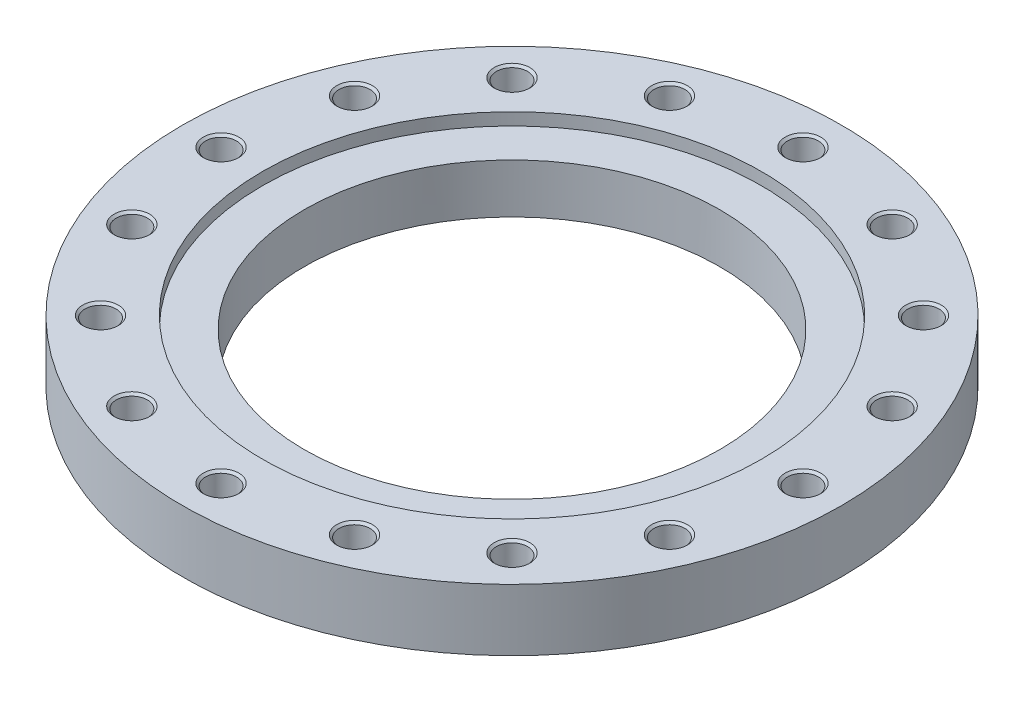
ISO-10303-21;
HEADER;
FILE_DESCRIPTION(('STEP AP214'),'2;1');
FILE_NAME('part.step','',(''),(''),'','','');
FILE_SCHEMA(('AUTOMOTIVE_DESIGN { 1 0 10303 214 1 1 1 1 }'));
ENDSEC;
DATA;
#1=APPLICATION_CONTEXT('core data for automotive mechanical design processes');
#2=APPLICATION_PROTOCOL_DEFINITION('international standard','automotive_design',2000,#1);
#3=PRODUCT_CONTEXT('',#1,'mechanical');
#4=PRODUCT('Part','Part','',(#3));
#5=PRODUCT_RELATED_PRODUCT_CATEGORY('part','',(#4));
#6=PRODUCT_DEFINITION_FORMATION('','',#4);
#7=PRODUCT_DEFINITION_CONTEXT('part definition',#1,'design');
#8=PRODUCT_DEFINITION('design','',#6,#7);
#9=PRODUCT_DEFINITION_SHAPE('','',#8);
#10=(LENGTH_UNIT() NAMED_UNIT(*) SI_UNIT(.MILLI.,.METRE.));
#11=(NAMED_UNIT(*) PLANE_ANGLE_UNIT() SI_UNIT($,.RADIAN.));
#12=(NAMED_UNIT(*) SI_UNIT($,.STERADIAN.) SOLID_ANGLE_UNIT());
#13=UNCERTAINTY_MEASURE_WITH_UNIT(LENGTH_MEASURE(1.E-05),#10,'distance_accuracy_value','');
#14=(GEOMETRIC_REPRESENTATION_CONTEXT(3) GLOBAL_UNCERTAINTY_ASSIGNED_CONTEXT((#13)) GLOBAL_UNIT_ASSIGNED_CONTEXT((#10,
#11,#12)) REPRESENTATION_CONTEXT('',''));
#15=CARTESIAN_POINT('',(0.,0.,0.));
#16=DIRECTION('',(0.,0.,1.));
#17=DIRECTION('',(1.,0.,0.));
#18=AXIS2_PLACEMENT_3D('',#15,#16,#17);
#19=CARTESIAN_POINT('',(0.,26.,0.));
#20=DIRECTION('',(0.,-1.,0.));
#21=DIRECTION('',(1.,0.,0.));
#22=AXIS2_PLACEMENT_3D('',#19,#20,#21);
#23=CYLINDRICAL_SURFACE('',#22,277.5);
#24=CARTESIAN_POINT('',(0.,0.,0.));
#25=DIRECTION('',(0.,1.,0.));
#26=DIRECTION('',(1.,0.,0.));
#27=AXIS2_PLACEMENT_3D('',#24,#25,#26);
#28=CIRCLE('',#27,277.5);
#29=CARTESIAN_POINT('',(277.5,0.,0.));
#30=VERTEX_POINT('',#29);
#31=EDGE_CURVE('E9',#30,#30,#28,.T.);
#32=ORIENTED_EDGE('',*,*,#31,.T.);
#33=EDGE_LOOP('',(#32));
#34=FACE_BOUND('',#33,.T.);
#35=CARTESIAN_POINT('',(0.,52.,0.));
#36=DIRECTION('',(0.,1.,0.));
#37=DIRECTION('',(1.,0.,0.));
#38=AXIS2_PLACEMENT_3D('',#35,#36,#37);
#39=CIRCLE('',#38,277.5);
#40=CARTESIAN_POINT('',(277.5,52.,0.));
#41=VERTEX_POINT('',#40);
#42=EDGE_CURVE('E361',#41,#41,#39,.T.);
#43=ORIENTED_EDGE('',*,*,#42,.F.);
#44=EDGE_LOOP('',(#43));
#45=FACE_BOUND('',#44,.T.);
#46=ADVANCED_FACE('F15',(#34,#45),#23,.T.);
#47=CARTESIAN_POINT('',(226.25,0.,0.));
#48=DIRECTION('',(0.,-1.,0.));
#49=DIRECTION('',(-1.,0.,0.));
#50=AXIS2_PLACEMENT_3D('',#47,#48,#49);
#51=PLANE('',#50);
#52=CARTESIAN_POINT('',(0.,0.,0.));
#53=DIRECTION('',(0.,1.,0.));
#54=DIRECTION('',(1.,0.,0.));
#55=AXIS2_PLACEMENT_3D('',#52,#53,#54);
#56=CIRCLE('',#55,175.);
#57=CARTESIAN_POINT('',(175.,0.,0.));
#58=VERTEX_POINT('',#57);
#59=EDGE_CURVE('E24',#58,#58,#56,.T.);
#60=ORIENTED_EDGE('',*,*,#59,.T.);
#61=EDGE_LOOP('',(#60));
#62=FACE_BOUND('',#61,.T.);
#63=ORIENTED_EDGE('',*,*,#31,.F.);
#64=EDGE_LOOP('',(#63));
#65=FACE_BOUND('',#64,.T.);
#66=ADVANCED_FACE('F526',(#62,#65),#51,.T.);
#67=CARTESIAN_POINT('',(0.,26.,0.));
#68=DIRECTION('',(0.,-1.,0.));
#69=DIRECTION('',(1.,0.,0.));
#70=AXIS2_PLACEMENT_3D('',#67,#68,#69);
#71=CYLINDRICAL_SURFACE('',#70,175.);
#72=ORIENTED_EDGE('',*,*,#59,.F.);
#73=EDGE_LOOP('',(#72));
#74=FACE_BOUND('',#73,.T.);
#75=CARTESIAN_POINT('',(0.,41.6,0.));
#76=DIRECTION('',(0.,1.,0.));
#77=DIRECTION('',(1.,0.,0.));
#78=AXIS2_PLACEMENT_3D('',#75,#76,#77);
#79=CIRCLE('',#78,175.);
#80=CARTESIAN_POINT('',(-175.,41.6,0.));
#81=VERTEX_POINT('',#80);
#82=EDGE_CURVE('E363',#81,#81,#79,.T.);
#83=ORIENTED_EDGE('',*,*,#82,.T.);
#84=EDGE_LOOP('',(#83));
#85=FACE_BOUND('',#84,.T.);
#86=ADVANCED_FACE('F17',(#74,#85),#71,.F.);
#87=CARTESIAN_POINT('',(226.25,52.,0.));
#88=DIRECTION('',(0.,1.,0.));
#89=DIRECTION('',(1.,0.,0.));
#90=AXIS2_PLACEMENT_3D('',#87,#88,#89);
#91=PLANE('',#90);
#92=ORIENTED_EDGE('',*,*,#42,.T.);
#93=EDGE_LOOP('',(#92));
#94=FACE_BOUND('',#93,.T.);
#95=CARTESIAN_POINT('',(0.,52.,0.));
#96=DIRECTION('',(0.,-1.,0.));
#97=DIRECTION('',(1.,0.,0.));
#98=AXIS2_PLACEMENT_3D('',#95,#96,#97);
#99=CIRCLE('',#98,210.);
#100=CARTESIAN_POINT('',(-210.,52.,0.));
#101=VERTEX_POINT('',#100);
#102=EDGE_CURVE('E278',#101,#101,#99,.T.);
#103=ORIENTED_EDGE('',*,*,#102,.T.);
#104=EDGE_LOOP('',(#103));
#105=FACE_BOUND('',#104,.T.);
#106=CARTESIAN_POINT('',(245.,52.,0.));
#107=DIRECTION('',(0.,-1.,0.));
#108=DIRECTION('',(1.,0.,0.));
#109=AXIS2_PLACEMENT_3D('',#106,#107,#108);
#110=CIRCLE('',#109,15.);
#111=CARTESIAN_POINT('',(260.,52.,0.));
#112=VERTEX_POINT('',#111);
#113=EDGE_CURVE('E440',#112,#112,#110,.T.);
#114=ORIENTED_EDGE('',*,*,#113,.T.);
#115=EDGE_LOOP('',(#114));
#116=FACE_BOUND('',#115,.T.);
#117=CARTESIAN_POINT('',(226.350485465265,52.,-93.757440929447));
#118=DIRECTION('',(0.,-1.,0.));
#119=DIRECTION('',(0.923879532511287,0.,-0.38268343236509));
#120=AXIS2_PLACEMENT_3D('',#117,#118,#119);
#121=CIRCLE('',#120,15.);
#122=CARTESIAN_POINT('',(240.208678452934,52.,-99.4976924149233));
#123=VERTEX_POINT('',#122);
#124=EDGE_CURVE('E431',#123,#123,#121,.T.);
#125=ORIENTED_EDGE('',*,*,#124,.T.);
#126=EDGE_LOOP('',(#125));
#127=FACE_BOUND('',#126,.T.);
#128=CARTESIAN_POINT('',(173.241161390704,52.,-173.241161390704));
#129=DIRECTION('',(0.,-1.,0.));
#130=DIRECTION('',(0.707106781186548,0.,-0.707106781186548));
#131=AXIS2_PLACEMENT_3D('',#128,#129,#130);
#132=CIRCLE('',#131,15.);
#133=CARTESIAN_POINT('',(183.847763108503,52.,-183.847763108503));
#134=VERTEX_POINT('',#133);
#135=EDGE_CURVE('E423',#134,#134,#132,.T.);
#136=ORIENTED_EDGE('',*,*,#135,.T.);
#137=EDGE_LOOP('',(#136));
#138=FACE_BOUND('',#137,.T.);
#139=CARTESIAN_POINT('',(93.757440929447,52.,-226.350485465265));
#140=DIRECTION('',(0.,-1.,0.));
#141=DIRECTION('',(0.38268343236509,0.,-0.923879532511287));
#142=AXIS2_PLACEMENT_3D('',#139,#140,#141);
#143=CIRCLE('',#142,15.);
#144=CARTESIAN_POINT('',(99.4976924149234,52.,-240.208678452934));
#145=VERTEX_POINT('',#144);
#146=EDGE_CURVE('E487',#145,#145,#143,.T.);
#147=ORIENTED_EDGE('',*,*,#146,.T.);
#148=EDGE_LOOP('',(#147));
#149=FACE_BOUND('',#148,.T.);
#150=CARTESIAN_POINT('',(0.,52.,-245.));
#151=DIRECTION('',(0.,-1.,0.));
#152=DIRECTION('',(0.,0.,-1.));
#153=AXIS2_PLACEMENT_3D('',#150,#151,#152);
#154=CIRCLE('',#153,15.);
#155=CARTESIAN_POINT('',(0.,52.,-260.));
#156=VERTEX_POINT('',#155);
#157=EDGE_CURVE('E468',#156,#156,#154,.T.);
#158=ORIENTED_EDGE('',*,*,#157,.T.);
#159=EDGE_LOOP('',(#158));
#160=FACE_BOUND('',#159,.T.);
#161=CARTESIAN_POINT('',(-93.757440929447,52.,-226.350485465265));
#162=DIRECTION('',(0.,-1.,0.));
#163=DIRECTION('',(-0.38268343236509,0.,-0.923879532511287));
#164=AXIS2_PLACEMENT_3D('',#161,#162,#163);
#165=CIRCLE('',#164,15.);
#166=CARTESIAN_POINT('',(-99.4976924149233,52.,-240.208678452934));
#167=VERTEX_POINT('',#166);
#168=EDGE_CURVE('E449',#167,#167,#165,.T.);
#169=ORIENTED_EDGE('',*,*,#168,.T.);
#170=EDGE_LOOP('',(#169));
#171=FACE_BOUND('',#170,.T.);
#172=CARTESIAN_POINT('',(-173.241161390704,52.,-173.241161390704));
#173=DIRECTION('',(0.,-1.,0.));
#174=DIRECTION('',(-0.707106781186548,0.,-0.707106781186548));
#175=AXIS2_PLACEMENT_3D('',#172,#173,#174);
#176=CIRCLE('',#175,15.);
#177=CARTESIAN_POINT('',(-183.847763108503,52.,-183.847763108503));
#178=VERTEX_POINT('',#177);
#179=EDGE_CURVE('E434',#178,#178,#176,.T.);
#180=ORIENTED_EDGE('',*,*,#179,.T.);
#181=EDGE_LOOP('',(#180));
#182=FACE_BOUND('',#181,.T.);
#183=CARTESIAN_POINT('',(-226.350485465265,52.,-93.757440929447));
#184=DIRECTION('',(0.,-1.,0.));
#185=DIRECTION('',(-0.923879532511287,0.,-0.38268343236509));
#186=AXIS2_PLACEMENT_3D('',#183,#184,#185);
#187=CIRCLE('',#186,15.);
#188=CARTESIAN_POINT('',(-240.208678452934,52.,-99.4976924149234));
#189=VERTEX_POINT('',#188);
#190=EDGE_CURVE('E418',#189,#189,#187,.T.);
#191=ORIENTED_EDGE('',*,*,#190,.T.);
#192=EDGE_LOOP('',(#191));
#193=FACE_BOUND('',#192,.T.);
#194=CARTESIAN_POINT('',(-245.,52.,0.));
#195=DIRECTION('',(0.,-1.,0.));
#196=DIRECTION('',(-1.,0.,0.));
#197=AXIS2_PLACEMENT_3D('',#194,#195,#196);
#198=CIRCLE('',#197,15.);
#199=CARTESIAN_POINT('',(-260.,52.,0.));
#200=VERTEX_POINT('',#199);
#201=EDGE_CURVE('E412',#200,#200,#198,.T.);
#202=ORIENTED_EDGE('',*,*,#201,.T.);
#203=EDGE_LOOP('',(#202));
#204=FACE_BOUND('',#203,.T.);
#205=CARTESIAN_POINT('',(-226.350485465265,52.,93.757440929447));
#206=DIRECTION('',(0.,-1.,0.));
#207=DIRECTION('',(-0.923879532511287,0.,0.38268343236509));
#208=AXIS2_PLACEMENT_3D('',#205,#206,#207);
#209=CIRCLE('',#208,15.);
#210=CARTESIAN_POINT('',(-240.208678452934,52.,99.4976924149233));
#211=VERTEX_POINT('',#210);
#212=EDGE_CURVE('E387',#211,#211,#209,.T.);
#213=ORIENTED_EDGE('',*,*,#212,.T.);
#214=EDGE_LOOP('',(#213));
#215=FACE_BOUND('',#214,.T.);
#216=CARTESIAN_POINT('',(-173.241161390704,52.,173.241161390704));
#217=DIRECTION('',(0.,-1.,0.));
#218=DIRECTION('',(-0.707106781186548,0.,0.707106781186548));
#219=AXIS2_PLACEMENT_3D('',#216,#217,#218);
#220=CIRCLE('',#219,15.);
#221=CARTESIAN_POINT('',(-183.847763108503,52.,183.847763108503));
#222=VERTEX_POINT('',#221);
#223=EDGE_CURVE('E375',#222,#222,#220,.T.);
#224=ORIENTED_EDGE('',*,*,#223,.T.);
#225=EDGE_LOOP('',(#224));
#226=FACE_BOUND('',#225,.T.);
#227=CARTESIAN_POINT('',(-93.7574409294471,52.,226.350485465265));
#228=DIRECTION('',(0.,-1.,0.));
#229=DIRECTION('',(-0.382683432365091,0.,0.923879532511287));
#230=AXIS2_PLACEMENT_3D('',#227,#228,#229);
#231=CIRCLE('',#230,15.);
#232=CARTESIAN_POINT('',(-99.4976924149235,52.,240.208678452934));
#233=VERTEX_POINT('',#232);
#234=EDGE_CURVE('E360',#233,#233,#231,.T.);
#235=ORIENTED_EDGE('',*,*,#234,.T.);
#236=EDGE_LOOP('',(#235));
#237=FACE_BOUND('',#236,.T.);
#238=CARTESIAN_POINT('',(0.,52.,245.));
#239=DIRECTION('',(0.,-1.,0.));
#240=DIRECTION('',(0.,0.,1.));
#241=AXIS2_PLACEMENT_3D('',#238,#239,#240);
#242=CIRCLE('',#241,15.);
#243=CARTESIAN_POINT('',(0.,52.,260.));
#244=VERTEX_POINT('',#243);
#245=EDGE_CURVE('E353',#244,#244,#242,.T.);
#246=ORIENTED_EDGE('',*,*,#245,.T.);
#247=EDGE_LOOP('',(#246));
#248=FACE_BOUND('',#247,.T.);
#249=CARTESIAN_POINT('',(93.757440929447,52.,226.350485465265));
#250=DIRECTION('',(0.,-1.,0.));
#251=DIRECTION('',(0.38268343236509,0.,0.923879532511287));
#252=AXIS2_PLACEMENT_3D('',#249,#250,#251);
#253=CIRCLE('',#252,15.);
#254=CARTESIAN_POINT('',(99.4976924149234,52.,240.208678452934));
#255=VERTEX_POINT('',#254);
#256=EDGE_CURVE('E921',#255,#255,#253,.T.);
#257=ORIENTED_EDGE('',*,*,#256,.T.);
#258=EDGE_LOOP('',(#257));
#259=FACE_BOUND('',#258,.T.);
#260=CARTESIAN_POINT('',(173.241161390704,52.,173.241161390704));
#261=DIRECTION('',(0.,-1.,0.));
#262=DIRECTION('',(0.707106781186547,0.,0.707106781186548));
#263=AXIS2_PLACEMENT_3D('',#260,#261,#262);
#264=CIRCLE('',#263,15.);
#265=CARTESIAN_POINT('',(183.847763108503,52.,183.847763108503));
#266=VERTEX_POINT('',#265);
#267=EDGE_CURVE('E925',#266,#266,#264,.T.);
#268=ORIENTED_EDGE('',*,*,#267,.T.);
#269=EDGE_LOOP('',(#268));
#270=FACE_BOUND('',#269,.T.);
#271=CARTESIAN_POINT('',(226.350485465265,52.,93.7574409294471));
#272=DIRECTION('',(0.,-1.,0.));
#273=DIRECTION('',(0.923879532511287,0.,0.382683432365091));
#274=AXIS2_PLACEMENT_3D('',#271,#272,#273);
#275=CIRCLE('',#274,15.);
#276=CARTESIAN_POINT('',(240.208678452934,52.,99.4976924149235));
#277=VERTEX_POINT('',#276);
#278=EDGE_CURVE('E929',#277,#277,#275,.T.);
#279=ORIENTED_EDGE('',*,*,#278,.T.);
#280=EDGE_LOOP('',(#279));
#281=FACE_BOUND('',#280,.T.);
#282=ADVANCED_FACE('F512',(#94,#105,#116,#127,#138,#149,#160,#171,#182,#193,#204,#215,#226,#237,
#248,#259,#270,#281),#91,.T.);
#283=CARTESIAN_POINT('',(0.,41.6,0.));
#284=DIRECTION('',(0.,-1.,0.));
#285=DIRECTION('',(-1.,0.,0.));
#286=AXIS2_PLACEMENT_3D('',#283,#284,#285);
#287=PLANE('',#286);
#288=CARTESIAN_POINT('',(0.,41.6,0.));
#289=DIRECTION('',(0.,-1.,0.));
#290=DIRECTION('',(1.,0.,0.));
#291=AXIS2_PLACEMENT_3D('',#288,#289,#290);
#292=CIRCLE('',#291,210.);
#293=CARTESIAN_POINT('',(210.,41.6,0.));
#294=VERTEX_POINT('',#293);
#295=EDGE_CURVE('E504',#294,#294,#292,.T.);
#296=ORIENTED_EDGE('',*,*,#295,.F.);
#297=EDGE_LOOP('',(#296));
#298=FACE_BOUND('',#297,.T.);
#299=ORIENTED_EDGE('',*,*,#82,.F.);
#300=EDGE_LOOP('',(#299));
#301=FACE_BOUND('',#300,.T.);
#302=ADVANCED_FACE('F509',(#298,#301),#287,.F.);
#303=CARTESIAN_POINT('',(0.,49.4,0.));
#304=DIRECTION('',(0.,-1.,0.));
#305=DIRECTION('',(1.,0.,0.));
#306=AXIS2_PLACEMENT_3D('',#303,#304,#305);
#307=CYLINDRICAL_SURFACE('',#306,210.);
#308=ORIENTED_EDGE('',*,*,#295,.T.);
#309=EDGE_LOOP('',(#308));
#310=FACE_BOUND('',#309,.T.);
#311=ORIENTED_EDGE('',*,*,#102,.F.);
#312=EDGE_LOOP('',(#311));
#313=FACE_BOUND('',#312,.T.);
#314=ADVANCED_FACE('F511',(#310,#313),#307,.F.);
#315=CARTESIAN_POINT('',(245.,8.21673193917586,0.));
#316=DIRECTION('',(0.,1.,0.));
#317=DIRECTION('',(1.,0.,0.));
#318=AXIS2_PLACEMENT_3D('',#315,#316,#317);
#319=CONICAL_SURFACE('',#318,6.5528125,1.0471975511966);
#320=CARTESIAN_POINT('',(245.,12.,0.));
#321=DIRECTION('',(0.,-1.,0.));
#322=DIRECTION('',(1.,0.,0.));
#323=AXIS2_PLACEMENT_3D('',#320,#321,#322);
#324=CIRCLE('',#323,13.105625);
#325=CARTESIAN_POINT('',(258.105625,12.,0.));
#326=VERTEX_POINT('',#325);
#327=EDGE_CURVE('E283',#326,#326,#324,.T.);
#328=ORIENTED_EDGE('',*,*,#327,.F.);
#329=EDGE_LOOP('',(#328));
#330=FACE_BOUND('',#329,.T.);
#331=CARTESIAN_POINT('',(245.,4.43346387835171,0.));
#332=VERTEX_POINT('',#331);
#333=VERTEX_LOOP('',#332);
#334=FACE_BOUND('',#333,.T.);
#335=ADVANCED_FACE('F520',(#330,#334),#319,.F.);
#336=CARTESIAN_POINT('',(245.,16.0528125,0.));
#337=DIRECTION('',(0.,1.,0.));
#338=DIRECTION('',(1.,0.,0.));
#339=AXIS2_PLACEMENT_3D('',#336,#337,#338);
#340=CYLINDRICAL_SURFACE('',#339,13.105625);
#341=CARTESIAN_POINT('',(245.,20.105625,0.));
#342=DIRECTION('',(0.,-1.,0.));
#343=DIRECTION('',(1.,0.,0.));
#344=AXIS2_PLACEMENT_3D('',#341,#342,#343);
#345=CIRCLE('',#344,13.105625);
#346=CARTESIAN_POINT('',(258.105625,20.105625,0.));
#347=VERTEX_POINT('',#346);
#348=EDGE_CURVE('E501',#347,#347,#345,.T.);
#349=ORIENTED_EDGE('',*,*,#348,.F.);
#350=EDGE_LOOP('',(#349));
#351=FACE_BOUND('',#350,.T.);
#352=ORIENTED_EDGE('',*,*,#327,.T.);
#353=EDGE_LOOP('',(#352));
#354=FACE_BOUND('',#353,.T.);
#355=ADVANCED_FACE('F651',(#351,#354),#340,.F.);
#356=CARTESIAN_POINT('',(245.,21.0528125,0.));
#357=DIRECTION('',(0.,1.,0.));
#358=DIRECTION('',(1.,0.,0.));
#359=AXIS2_PLACEMENT_3D('',#356,#357,#358);
#360=CONICAL_SURFACE('',#359,14.0528125,0.785398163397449);
#361=CARTESIAN_POINT('',(245.,22.,0.));
#362=DIRECTION('',(0.,-1.,0.));
#363=DIRECTION('',(1.,0.,0.));
#364=AXIS2_PLACEMENT_3D('',#361,#362,#363);
#365=CIRCLE('',#364,15.);
#366=CARTESIAN_POINT('',(260.,22.,0.));
#367=VERTEX_POINT('',#366);
#368=EDGE_CURVE('E439',#367,#367,#365,.T.);
#369=ORIENTED_EDGE('',*,*,#368,.F.);
#370=EDGE_LOOP('',(#369));
#371=FACE_BOUND('',#370,.T.);
#372=ORIENTED_EDGE('',*,*,#348,.T.);
#373=EDGE_LOOP('',(#372));
#374=FACE_BOUND('',#373,.T.);
#375=ADVANCED_FACE('F647',(#371,#374),#360,.F.);
#376=CARTESIAN_POINT('',(259.0528125,22.,0.));
#377=DIRECTION('',(0.,1.,0.));
#378=DIRECTION('',(-1.,0.,0.));
#379=AXIS2_PLACEMENT_3D('',#376,#377,#378);
#380=PLANE('',#379);
#381=CARTESIAN_POINT('',(245.,22.,0.));
#382=DIRECTION('',(0.,-1.,0.));
#383=DIRECTION('',(1.,0.,0.));
#384=AXIS2_PLACEMENT_3D('',#381,#382,#383);
#385=CIRCLE('',#384,13.105625);
#386=CARTESIAN_POINT('',(258.105625,22.,0.));
#387=VERTEX_POINT('',#386);
#388=EDGE_CURVE('E437',#387,#387,#385,.T.);
#389=ORIENTED_EDGE('',*,*,#388,.F.);
#390=EDGE_LOOP('',(#389));
#391=FACE_BOUND('',#390,.T.);
#392=ORIENTED_EDGE('',*,*,#368,.T.);
#393=EDGE_LOOP('',(#392));
#394=FACE_BOUND('',#393,.T.);
#395=ADVANCED_FACE('F650',(#391,#394),#380,.F.);
#396=CARTESIAN_POINT('',(245.,36.0528125,0.));
#397=DIRECTION('',(0.,1.,0.));
#398=DIRECTION('',(1.,0.,0.));
#399=AXIS2_PLACEMENT_3D('',#396,#397,#398);
#400=CYLINDRICAL_SURFACE('',#399,13.105625);
#401=CARTESIAN_POINT('',(245.,50.105625,0.));
#402=DIRECTION('',(0.,-1.,0.));
#403=DIRECTION('',(1.,0.,0.));
#404=AXIS2_PLACEMENT_3D('',#401,#402,#403);
#405=CIRCLE('',#404,13.105625);
#406=CARTESIAN_POINT('',(258.105625,50.105625,0.));
#407=VERTEX_POINT('',#406);
#408=EDGE_CURVE('E444',#407,#407,#405,.T.);
#409=ORIENTED_EDGE('',*,*,#408,.F.);
#410=EDGE_LOOP('',(#409));
#411=FACE_BOUND('',#410,.T.);
#412=ORIENTED_EDGE('',*,*,#388,.T.);
#413=EDGE_LOOP('',(#412));
#414=FACE_BOUND('',#413,.T.);
#415=ADVANCED_FACE('F885',(#411,#414),#400,.F.);
#416=CARTESIAN_POINT('',(245.,51.0528125,0.));
#417=DIRECTION('',(0.,1.,0.));
#418=DIRECTION('',(1.,0.,0.));
#419=AXIS2_PLACEMENT_3D('',#416,#417,#418);
#420=CONICAL_SURFACE('',#419,14.0528125,0.785398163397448);
#421=ORIENTED_EDGE('',*,*,#113,.F.);
#422=EDGE_LOOP('',(#421));
#423=FACE_BOUND('',#422,.T.);
#424=ORIENTED_EDGE('',*,*,#408,.T.);
#425=EDGE_LOOP('',(#424));
#426=FACE_BOUND('',#425,.T.);
#427=ADVANCED_FACE('F881',(#423,#426),#420,.F.);
#428=CARTESIAN_POINT('',(226.350485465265,8.21673193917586,-93.757440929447));
#429=DIRECTION('',(0.,1.,0.));
#430=DIRECTION('',(0.923879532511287,0.,-0.38268343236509));
#431=AXIS2_PLACEMENT_3D('',#428,#429,#430);
#432=CONICAL_SURFACE('',#431,6.5528125,1.0471975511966);
#433=CARTESIAN_POINT('',(226.350485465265,12.,-93.757440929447));
#434=DIRECTION('',(0.,-1.,0.));
#435=DIRECTION('',(0.923879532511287,0.,-0.38268343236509));
#436=AXIS2_PLACEMENT_3D('',#433,#434,#435);
#437=CIRCLE('',#436,13.105625);
#438=CARTESIAN_POINT('',(238.458504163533,12.,-98.7727464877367));
#439=VERTEX_POINT('',#438);
#440=EDGE_CURVE('E442',#439,#439,#437,.T.);
#441=ORIENTED_EDGE('',*,*,#440,.F.);
#442=EDGE_LOOP('',(#441));
#443=FACE_BOUND('',#442,.T.);
#444=CARTESIAN_POINT('',(226.350485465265,4.43346387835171,-93.757440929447));
#445=VERTEX_POINT('',#444);
#446=VERTEX_LOOP('',#445);
#447=FACE_BOUND('',#446,.T.);
#448=ADVANCED_FACE('F795',(#443,#447),#432,.F.);
#449=CARTESIAN_POINT('',(226.350485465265,16.0528125,-93.757440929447));
#450=DIRECTION('',(0.,1.,0.));
#451=DIRECTION('',(0.923879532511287,0.,-0.38268343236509));
#452=AXIS2_PLACEMENT_3D('',#449,#450,#451);
#453=CYLINDRICAL_SURFACE('',#452,13.105625);
#454=CARTESIAN_POINT('',(226.350485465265,20.105625,-93.757440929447));
#455=DIRECTION('',(0.,-1.,0.));
#456=DIRECTION('',(0.923879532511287,0.,-0.38268343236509));
#457=AXIS2_PLACEMENT_3D('',#454,#455,#456);
#458=CIRCLE('',#457,13.105625);
#459=CARTESIAN_POINT('',(238.458504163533,20.105625,-98.7727464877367));
#460=VERTEX_POINT('',#459);
#461=EDGE_CURVE('E445',#460,#460,#458,.T.);
#462=ORIENTED_EDGE('',*,*,#461,.F.);
#463=EDGE_LOOP('',(#462));
#464=FACE_BOUND('',#463,.T.);
#465=ORIENTED_EDGE('',*,*,#440,.T.);
#466=EDGE_LOOP('',(#465));
#467=FACE_BOUND('',#466,.T.);
#468=ADVANCED_FACE('F772',(#464,#467),#453,.F.);
#469=CARTESIAN_POINT('',(226.350485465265,21.0528125,-93.757440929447));
#470=DIRECTION('',(0.,1.,0.));
#471=DIRECTION('',(0.923879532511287,0.,-0.38268343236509));
#472=AXIS2_PLACEMENT_3D('',#469,#470,#471);
#473=CONICAL_SURFACE('',#472,14.0528125,0.785398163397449);
#474=CARTESIAN_POINT('',(226.350485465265,22.,-93.757440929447));
#475=DIRECTION('',(0.,-1.,0.));
#476=DIRECTION('',(0.923879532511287,0.,-0.38268343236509));
#477=AXIS2_PLACEMENT_3D('',#474,#475,#476);
#478=CIRCLE('',#477,15.);
#479=CARTESIAN_POINT('',(240.208678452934,22.,-99.4976924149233));
#480=VERTEX_POINT('',#479);
#481=EDGE_CURVE('E453',#480,#480,#478,.T.);
#482=ORIENTED_EDGE('',*,*,#481,.F.);
#483=EDGE_LOOP('',(#482));
#484=FACE_BOUND('',#483,.T.);
#485=ORIENTED_EDGE('',*,*,#461,.T.);
#486=EDGE_LOOP('',(#485));
#487=FACE_BOUND('',#486,.T.);
#488=ADVANCED_FACE('F768',(#484,#487),#473,.F.);
#489=CARTESIAN_POINT('',(239.333591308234,22.,-99.13521945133));
#490=DIRECTION('',(0.,1.,0.));
#491=DIRECTION('',(-0.923879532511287,0.,0.38268343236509));
#492=AXIS2_PLACEMENT_3D('',#489,#490,#491);
#493=PLANE('',#492);
#494=CARTESIAN_POINT('',(226.350485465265,22.,-93.757440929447));
#495=DIRECTION('',(0.,-1.,0.));
#496=DIRECTION('',(0.923879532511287,0.,-0.38268343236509));
#497=AXIS2_PLACEMENT_3D('',#494,#495,#496);
#498=CIRCLE('',#497,13.105625);
#499=CARTESIAN_POINT('',(238.458504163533,22.,-98.7727464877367));
#500=VERTEX_POINT('',#499);
#501=EDGE_CURVE('E455',#500,#500,#498,.T.);
#502=ORIENTED_EDGE('',*,*,#501,.F.);
#503=EDGE_LOOP('',(#502));
#504=FACE_BOUND('',#503,.T.);
#505=ORIENTED_EDGE('',*,*,#481,.T.);
#506=EDGE_LOOP('',(#505));
#507=FACE_BOUND('',#506,.T.);
#508=ADVANCED_FACE('F771',(#504,#507),#493,.F.);
#509=CARTESIAN_POINT('',(226.350485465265,36.0528125,-93.757440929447));
#510=DIRECTION('',(0.,1.,0.));
#511=DIRECTION('',(0.923879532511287,0.,-0.38268343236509));
#512=AXIS2_PLACEMENT_3D('',#509,#510,#511);
#513=CYLINDRICAL_SURFACE('',#512,13.105625);
#514=CARTESIAN_POINT('',(226.350485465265,50.105625,-93.757440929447));
#515=DIRECTION('',(0.,-1.,0.));
#516=DIRECTION('',(0.923879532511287,0.,-0.38268343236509));
#517=AXIS2_PLACEMENT_3D('',#514,#515,#516);
#518=CIRCLE('',#517,13.105625);
#519=CARTESIAN_POINT('',(238.458504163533,50.105625,-98.7727464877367));
#520=VERTEX_POINT('',#519);
#521=EDGE_CURVE('E429',#520,#520,#518,.T.);
#522=ORIENTED_EDGE('',*,*,#521,.F.);
#523=EDGE_LOOP('',(#522));
#524=FACE_BOUND('',#523,.T.);
#525=ORIENTED_EDGE('',*,*,#501,.T.);
#526=EDGE_LOOP('',(#525));
#527=FACE_BOUND('',#526,.T.);
#528=ADVANCED_FACE('F871',(#524,#527),#513,.F.);
#529=CARTESIAN_POINT('',(226.350485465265,51.0528125,-93.757440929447));
#530=DIRECTION('',(0.,1.,0.));
#531=DIRECTION('',(0.923879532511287,0.,-0.38268343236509));
#532=AXIS2_PLACEMENT_3D('',#529,#530,#531);
#533=CONICAL_SURFACE('',#532,14.0528125,0.785398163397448);
#534=ORIENTED_EDGE('',*,*,#124,.F.);
#535=EDGE_LOOP('',(#534));
#536=FACE_BOUND('',#535,.T.);
#537=ORIENTED_EDGE('',*,*,#521,.T.);
#538=EDGE_LOOP('',(#537));
#539=FACE_BOUND('',#538,.T.);
#540=ADVANCED_FACE('F738',(#536,#539),#533,.F.);
#541=CARTESIAN_POINT('',(173.241161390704,8.21673193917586,-173.241161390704));
#542=DIRECTION('',(0.,1.,0.));
#543=DIRECTION('',(0.707106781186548,0.,-0.707106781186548));
#544=AXIS2_PLACEMENT_3D('',#541,#542,#543);
#545=CONICAL_SURFACE('',#544,6.5528125,1.0471975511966);
#546=CARTESIAN_POINT('',(173.241161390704,12.,-173.241161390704));
#547=DIRECTION('',(0.,-1.,0.));
#548=DIRECTION('',(0.707106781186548,0.,-0.707106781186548));
#549=AXIS2_PLACEMENT_3D('',#546,#547,#548);
#550=CIRCLE('',#549,13.105625);
#551=CARTESIAN_POINT('',(182.508237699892,12.,-182.508237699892));
#552=VERTEX_POINT('',#551);
#553=EDGE_CURVE('E432',#552,#552,#550,.T.);
#554=ORIENTED_EDGE('',*,*,#553,.F.);
#555=EDGE_LOOP('',(#554));
#556=FACE_BOUND('',#555,.T.);
#557=CARTESIAN_POINT('',(173.241161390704,4.43346387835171,-173.241161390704));
#558=VERTEX_POINT('',#557);
#559=VERTEX_LOOP('',#558);
#560=FACE_BOUND('',#559,.T.);
#561=ADVANCED_FACE('F734',(#556,#560),#545,.F.);
#562=CARTESIAN_POINT('',(173.241161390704,16.0528125,-173.241161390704));
#563=DIRECTION('',(0.,1.,0.));
#564=DIRECTION('',(0.707106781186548,0.,-0.707106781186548));
#565=AXIS2_PLACEMENT_3D('',#562,#563,#564);
#566=CYLINDRICAL_SURFACE('',#565,13.105625);
#567=CARTESIAN_POINT('',(173.241161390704,20.105625,-173.241161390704));
#568=DIRECTION('',(0.,-1.,0.));
#569=DIRECTION('',(0.707106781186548,0.,-0.707106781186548));
#570=AXIS2_PLACEMENT_3D('',#567,#568,#569);
#571=CIRCLE('',#570,13.105625);
#572=CARTESIAN_POINT('',(182.508237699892,20.105625,-182.508237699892));
#573=VERTEX_POINT('',#572);
#574=EDGE_CURVE('E475',#573,#573,#571,.T.);
#575=ORIENTED_EDGE('',*,*,#574,.F.);
#576=EDGE_LOOP('',(#575));
#577=FACE_BOUND('',#576,.T.);
#578=ORIENTED_EDGE('',*,*,#553,.T.);
#579=EDGE_LOOP('',(#578));
#580=FACE_BOUND('',#579,.T.);
#581=ADVANCED_FACE('F737',(#577,#580),#566,.F.);
#582=CARTESIAN_POINT('',(173.241161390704,21.0528125,-173.241161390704));
#583=DIRECTION('',(0.,1.,0.));
#584=DIRECTION('',(0.707106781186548,0.,-0.707106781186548));
#585=AXIS2_PLACEMENT_3D('',#582,#583,#584);
#586=CONICAL_SURFACE('',#585,14.0528125,0.785398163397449);
#587=CARTESIAN_POINT('',(173.241161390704,22.,-173.241161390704));
#588=DIRECTION('',(0.,-1.,0.));
#589=DIRECTION('',(0.707106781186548,0.,-0.707106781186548));
#590=AXIS2_PLACEMENT_3D('',#587,#588,#589);
#591=CIRCLE('',#590,15.);
#592=CARTESIAN_POINT('',(183.847763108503,22.,-183.847763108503));
#593=VERTEX_POINT('',#592);
#594=EDGE_CURVE('E422',#593,#593,#591,.T.);
#595=ORIENTED_EDGE('',*,*,#594,.F.);
#596=EDGE_LOOP('',(#595));
#597=FACE_BOUND('',#596,.T.);
#598=ORIENTED_EDGE('',*,*,#574,.T.);
#599=EDGE_LOOP('',(#598));
#600=FACE_BOUND('',#599,.T.);
#601=ADVANCED_FACE('F779',(#597,#600),#586,.F.);
#602=CARTESIAN_POINT('',(183.178000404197,22.,-183.178000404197));
#603=DIRECTION('',(0.,1.,0.));
#604=DIRECTION('',(-0.707106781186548,0.,0.707106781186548));
#605=AXIS2_PLACEMENT_3D('',#602,#603,#604);
#606=PLANE('',#605);
#607=CARTESIAN_POINT('',(173.241161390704,22.,-173.241161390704));
#608=DIRECTION('',(0.,-1.,0.));
#609=DIRECTION('',(0.707106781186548,0.,-0.707106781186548));
#610=AXIS2_PLACEMENT_3D('',#607,#608,#609);
#611=CIRCLE('',#610,13.105625);
#612=CARTESIAN_POINT('',(182.508237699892,22.,-182.508237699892));
#613=VERTEX_POINT('',#612);
#614=EDGE_CURVE('E419',#613,#613,#611,.T.);
#615=ORIENTED_EDGE('',*,*,#614,.F.);
#616=EDGE_LOOP('',(#615));
#617=FACE_BOUND('',#616,.T.);
#618=ORIENTED_EDGE('',*,*,#594,.T.);
#619=EDGE_LOOP('',(#618));
#620=FACE_BOUND('',#619,.T.);
#621=ADVANCED_FACE('F837',(#617,#620),#606,.F.);
#622=CARTESIAN_POINT('',(173.241161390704,36.0528125,-173.241161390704));
#623=DIRECTION('',(0.,1.,0.));
#624=DIRECTION('',(0.707106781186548,0.,-0.707106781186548));
#625=AXIS2_PLACEMENT_3D('',#622,#623,#624);
#626=CYLINDRICAL_SURFACE('',#625,13.105625);
#627=CARTESIAN_POINT('',(173.241161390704,50.105625,-173.241161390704));
#628=DIRECTION('',(0.,-1.,0.));
#629=DIRECTION('',(0.707106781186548,0.,-0.707106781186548));
#630=AXIS2_PLACEMENT_3D('',#627,#628,#629);
#631=CIRCLE('',#630,13.105625);
#632=CARTESIAN_POINT('',(182.508237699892,50.105625,-182.508237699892));
#633=VERTEX_POINT('',#632);
#634=EDGE_CURVE('E469',#633,#633,#631,.T.);
#635=ORIENTED_EDGE('',*,*,#634,.F.);
#636=EDGE_LOOP('',(#635));
#637=FACE_BOUND('',#636,.T.);
#638=ORIENTED_EDGE('',*,*,#614,.T.);
#639=EDGE_LOOP('',(#638));
#640=FACE_BOUND('',#639,.T.);
#641=ADVANCED_FACE('F833',(#637,#640),#626,.F.);
#642=CARTESIAN_POINT('',(173.241161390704,51.0528125,-173.241161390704));
#643=DIRECTION('',(0.,1.,0.));
#644=DIRECTION('',(0.707106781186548,0.,-0.707106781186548));
#645=AXIS2_PLACEMENT_3D('',#642,#643,#644);
#646=CONICAL_SURFACE('',#645,14.0528125,0.785398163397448);
#647=ORIENTED_EDGE('',*,*,#135,.F.);
#648=EDGE_LOOP('',(#647));
#649=FACE_BOUND('',#648,.T.);
#650=ORIENTED_EDGE('',*,*,#634,.T.);
#651=EDGE_LOOP('',(#650));
#652=FACE_BOUND('',#651,.T.);
#653=ADVANCED_FACE('F836',(#649,#652),#646,.F.);
#654=CARTESIAN_POINT('',(93.757440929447,8.21673193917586,-226.350485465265));
#655=DIRECTION('',(0.,1.,0.));
#656=DIRECTION('',(0.38268343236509,0.,-0.923879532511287));
#657=AXIS2_PLACEMENT_3D('',#654,#655,#656);
#658=CONICAL_SURFACE('',#657,6.5528125,1.0471975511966);
#659=CARTESIAN_POINT('',(93.757440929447,12.,-226.350485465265));
#660=DIRECTION('',(0.,-1.,0.));
#661=DIRECTION('',(0.38268343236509,0.,-0.923879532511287));
#662=AXIS2_PLACEMENT_3D('',#659,#660,#661);
#663=CIRCLE('',#662,13.105625);
#664=CARTESIAN_POINT('',(98.7727464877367,12.,-238.458504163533));
#665=VERTEX_POINT('',#664);
#666=EDGE_CURVE('E471',#665,#665,#663,.T.);
#667=ORIENTED_EDGE('',*,*,#666,.F.);
#668=EDGE_LOOP('',(#667));
#669=FACE_BOUND('',#668,.T.);
#670=CARTESIAN_POINT('',(93.757440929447,4.43346387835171,-226.350485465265));
#671=VERTEX_POINT('',#670);
#672=VERTEX_LOOP('',#671);
#673=FACE_BOUND('',#672,.T.);
#674=ADVANCED_FACE('F842',(#669,#673),#658,.F.);
#675=CARTESIAN_POINT('',(93.757440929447,16.0528125,-226.350485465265));
#676=DIRECTION('',(0.,1.,0.));
#677=DIRECTION('',(0.38268343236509,0.,-0.923879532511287));
#678=AXIS2_PLACEMENT_3D('',#675,#676,#677);
#679=CYLINDRICAL_SURFACE('',#678,13.105625);
#680=CARTESIAN_POINT('',(93.757440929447,20.105625,-226.350485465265));
#681=DIRECTION('',(0.,-1.,0.));
#682=DIRECTION('',(0.38268343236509,0.,-0.923879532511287));
#683=AXIS2_PLACEMENT_3D('',#680,#681,#682);
#684=CIRCLE('',#683,13.105625);
#685=CARTESIAN_POINT('',(98.7727464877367,20.105625,-238.458504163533));
#686=VERTEX_POINT('',#685);
#687=EDGE_CURVE('E494',#686,#686,#684,.T.);
#688=ORIENTED_EDGE('',*,*,#687,.F.);
#689=EDGE_LOOP('',(#688));
#690=FACE_BOUND('',#689,.T.);
#691=ORIENTED_EDGE('',*,*,#666,.T.);
#692=EDGE_LOOP('',(#691));
#693=FACE_BOUND('',#692,.T.);
#694=ADVANCED_FACE('F845',(#690,#693),#679,.F.);
#695=CARTESIAN_POINT('',(93.757440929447,21.0528125,-226.350485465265));
#696=DIRECTION('',(0.,1.,0.));
#697=DIRECTION('',(0.38268343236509,0.,-0.923879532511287));
#698=AXIS2_PLACEMENT_3D('',#695,#696,#697);
#699=CONICAL_SURFACE('',#698,14.0528125,0.785398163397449);
#700=CARTESIAN_POINT('',(93.757440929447,22.,-226.350485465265));
#701=DIRECTION('',(0.,-1.,0.));
#702=DIRECTION('',(0.38268343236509,0.,-0.923879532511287));
#703=AXIS2_PLACEMENT_3D('',#700,#701,#702);
#704=CIRCLE('',#703,15.);
#705=CARTESIAN_POINT('',(99.4976924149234,22.,-240.208678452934));
#706=VERTEX_POINT('',#705);
#707=EDGE_CURVE('E491',#706,#706,#704,.T.);
#708=ORIENTED_EDGE('',*,*,#707,.F.);
#709=EDGE_LOOP('',(#708));
#710=FACE_BOUND('',#709,.T.);
#711=ORIENTED_EDGE('',*,*,#687,.T.);
#712=EDGE_LOOP('',(#711));
#713=FACE_BOUND('',#712,.T.);
#714=ADVANCED_FACE('F852',(#710,#713),#699,.F.);
#715=CARTESIAN_POINT('',(99.1352194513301,22.,-239.333591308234));
#716=DIRECTION('',(0.,1.,0.));
#717=DIRECTION('',(-0.38268343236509,0.,0.923879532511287));
#718=AXIS2_PLACEMENT_3D('',#715,#716,#717);
#719=PLANE('',#718);
#720=CARTESIAN_POINT('',(93.757440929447,22.,-226.350485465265));
#721=DIRECTION('',(0.,-1.,0.));
#722=DIRECTION('',(0.38268343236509,0.,-0.923879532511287));
#723=AXIS2_PLACEMENT_3D('',#720,#721,#722);
#724=CIRCLE('',#723,13.105625);
#725=CARTESIAN_POINT('',(98.7727464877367,22.,-238.458504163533));
#726=VERTEX_POINT('',#725);
#727=EDGE_CURVE('E489',#726,#726,#724,.T.);
#728=ORIENTED_EDGE('',*,*,#727,.F.);
#729=EDGE_LOOP('',(#728));
#730=FACE_BOUND('',#729,.T.);
#731=ORIENTED_EDGE('',*,*,#707,.T.);
#732=EDGE_LOOP('',(#731));
#733=FACE_BOUND('',#732,.T.);
#734=ADVANCED_FACE('F559',(#730,#733),#719,.F.);
#735=CARTESIAN_POINT('',(93.757440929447,36.0528125,-226.350485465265));
#736=DIRECTION('',(0.,1.,0.));
#737=DIRECTION('',(0.38268343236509,0.,-0.923879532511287));
#738=AXIS2_PLACEMENT_3D('',#735,#736,#737);
#739=CYLINDRICAL_SURFACE('',#738,13.105625);
#740=CARTESIAN_POINT('',(93.757440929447,50.105625,-226.350485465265));
#741=DIRECTION('',(0.,-1.,0.));
#742=DIRECTION('',(0.38268343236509,0.,-0.923879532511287));
#743=AXIS2_PLACEMENT_3D('',#740,#741,#742);
#744=CIRCLE('',#743,13.105625);
#745=CARTESIAN_POINT('',(98.7727464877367,50.105625,-238.458504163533));
#746=VERTEX_POINT('',#745);
#747=EDGE_CURVE('E484',#746,#746,#744,.T.);
#748=ORIENTED_EDGE('',*,*,#747,.F.);
#749=EDGE_LOOP('',(#748));
#750=FACE_BOUND('',#749,.T.);
#751=ORIENTED_EDGE('',*,*,#727,.T.);
#752=EDGE_LOOP('',(#751));
#753=FACE_BOUND('',#752,.T.);
#754=ADVANCED_FACE('F555',(#750,#753),#739,.F.);
#755=CARTESIAN_POINT('',(93.757440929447,51.0528125,-226.350485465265));
#756=DIRECTION('',(0.,1.,0.));
#757=DIRECTION('',(0.38268343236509,0.,-0.923879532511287));
#758=AXIS2_PLACEMENT_3D('',#755,#756,#757);
#759=CONICAL_SURFACE('',#758,14.0528125,0.785398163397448);
#760=ORIENTED_EDGE('',*,*,#146,.F.);
#761=EDGE_LOOP('',(#760));
#762=FACE_BOUND('',#761,.T.);
#763=ORIENTED_EDGE('',*,*,#747,.T.);
#764=EDGE_LOOP('',(#763));
#765=FACE_BOUND('',#764,.T.);
#766=ADVANCED_FACE('F558',(#762,#765),#759,.F.);
#767=CARTESIAN_POINT('',(0.,8.21673193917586,-245.));
#768=DIRECTION('',(0.,1.,0.));
#769=DIRECTION('',(0.,0.,-1.));
#770=AXIS2_PLACEMENT_3D('',#767,#768,#769);
#771=CONICAL_SURFACE('',#770,6.5528125,1.0471975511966);
#772=CARTESIAN_POINT('',(0.,12.,-245.));
#773=DIRECTION('',(0.,-1.,0.));
#774=DIRECTION('',(0.,0.,-1.));
#775=AXIS2_PLACEMENT_3D('',#772,#773,#774);
#776=CIRCLE('',#775,13.105625);
#777=CARTESIAN_POINT('',(0.,12.,-258.105625));
#778=VERTEX_POINT('',#777);
#779=EDGE_CURVE('E482',#778,#778,#776,.T.);
#780=ORIENTED_EDGE('',*,*,#779,.F.);
#781=EDGE_LOOP('',(#780));
#782=FACE_BOUND('',#781,.T.);
#783=CARTESIAN_POINT('',(0.,4.43346387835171,-245.));
#784=VERTEX_POINT('',#783);
#785=VERTEX_LOOP('',#784);
#786=FACE_BOUND('',#785,.T.);
#787=ADVANCED_FACE('F619',(#782,#786),#771,.F.);
#788=CARTESIAN_POINT('',(0.,16.0528125,-245.));
#789=DIRECTION('',(0.,1.,0.));
#790=DIRECTION('',(0.,0.,-1.));
#791=AXIS2_PLACEMENT_3D('',#788,#789,#790);
#792=CYLINDRICAL_SURFACE('',#791,13.105625);
#793=CARTESIAN_POINT('',(0.,20.105625,-245.));
#794=DIRECTION('',(0.,-1.,0.));
#795=DIRECTION('',(0.,0.,-1.));
#796=AXIS2_PLACEMENT_3D('',#793,#794,#795);
#797=CIRCLE('',#796,13.105625);
#798=CARTESIAN_POINT('',(0.,20.105625,-258.105625));
#799=VERTEX_POINT('',#798);
#800=EDGE_CURVE('E480',#799,#799,#797,.T.);
#801=ORIENTED_EDGE('',*,*,#800,.F.);
#802=EDGE_LOOP('',(#801));
#803=FACE_BOUND('',#802,.T.);
#804=ORIENTED_EDGE('',*,*,#779,.T.);
#805=EDGE_LOOP('',(#804));
#806=FACE_BOUND('',#805,.T.);
#807=ADVANCED_FACE('F831',(#803,#806),#792,.F.);
#808=CARTESIAN_POINT('',(0.,21.0528125,-245.));
#809=DIRECTION('',(0.,1.,0.));
#810=DIRECTION('',(0.,0.,-1.));
#811=AXIS2_PLACEMENT_3D('',#808,#809,#810);
#812=CONICAL_SURFACE('',#811,14.0528125,0.785398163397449);
#813=CARTESIAN_POINT('',(0.,22.,-245.));
#814=DIRECTION('',(0.,-1.,0.));
#815=DIRECTION('',(0.,0.,-1.));
#816=AXIS2_PLACEMENT_3D('',#813,#814,#815);
#817=CIRCLE('',#816,15.);
#818=CARTESIAN_POINT('',(0.,22.,-260.));
#819=VERTEX_POINT('',#818);
#820=EDGE_CURVE('E477',#819,#819,#817,.T.);
#821=ORIENTED_EDGE('',*,*,#820,.F.);
#822=EDGE_LOOP('',(#821));
#823=FACE_BOUND('',#822,.T.);
#824=ORIENTED_EDGE('',*,*,#800,.T.);
#825=EDGE_LOOP('',(#824));
#826=FACE_BOUND('',#825,.T.);
#827=ADVANCED_FACE('F827',(#823,#826),#812,.F.);
#828=CARTESIAN_POINT('',(0.,22.,-259.0528125));
#829=DIRECTION('',(0.,1.,0.));
#830=DIRECTION('',(0.,0.,1.));
#831=AXIS2_PLACEMENT_3D('',#828,#829,#830);
#832=PLANE('',#831);
#833=CARTESIAN_POINT('',(0.,22.,-245.));
#834=DIRECTION('',(0.,-1.,0.));
#835=DIRECTION('',(0.,0.,-1.));
#836=AXIS2_PLACEMENT_3D('',#833,#834,#835);
#837=CIRCLE('',#836,13.105625);
#838=CARTESIAN_POINT('',(0.,22.,-258.105625));
#839=VERTEX_POINT('',#838);
#840=EDGE_CURVE('E473',#839,#839,#837,.T.);
#841=ORIENTED_EDGE('',*,*,#840,.F.);
#842=EDGE_LOOP('',(#841));
#843=FACE_BOUND('',#842,.T.);
#844=ORIENTED_EDGE('',*,*,#820,.T.);
#845=EDGE_LOOP('',(#844));
#846=FACE_BOUND('',#845,.T.);
#847=ADVANCED_FACE('F823',(#843,#846),#832,.F.);
#848=CARTESIAN_POINT('',(0.,36.0528125,-245.));
#849=DIRECTION('',(0.,1.,0.));
#850=DIRECTION('',(0.,0.,-1.));
#851=AXIS2_PLACEMENT_3D('',#848,#849,#850);
#852=CYLINDRICAL_SURFACE('',#851,13.105625);
#853=CARTESIAN_POINT('',(0.,50.105625,-245.));
#854=DIRECTION('',(0.,-1.,0.));
#855=DIRECTION('',(0.,0.,-1.));
#856=AXIS2_PLACEMENT_3D('',#853,#854,#855);
#857=CIRCLE('',#856,13.105625);
#858=CARTESIAN_POINT('',(0.,50.105625,-258.105625));
#859=VERTEX_POINT('',#858);
#860=EDGE_CURVE('E466',#859,#859,#857,.T.);
#861=ORIENTED_EDGE('',*,*,#860,.F.);
#862=EDGE_LOOP('',(#861));
#863=FACE_BOUND('',#862,.T.);
#864=ORIENTED_EDGE('',*,*,#840,.T.);
#865=EDGE_LOOP('',(#864));
#866=FACE_BOUND('',#865,.T.);
#867=ADVANCED_FACE('F819',(#863,#866),#852,.F.);
#868=CARTESIAN_POINT('',(0.,51.0528125,-245.));
#869=DIRECTION('',(0.,1.,0.));
#870=DIRECTION('',(0.,0.,-1.));
#871=AXIS2_PLACEMENT_3D('',#868,#869,#870);
#872=CONICAL_SURFACE('',#871,14.0528125,0.785398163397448);
#873=ORIENTED_EDGE('',*,*,#157,.F.);
#874=EDGE_LOOP('',(#873));
#875=FACE_BOUND('',#874,.T.);
#876=ORIENTED_EDGE('',*,*,#860,.T.);
#877=EDGE_LOOP('',(#876));
#878=FACE_BOUND('',#877,.T.);
#879=ADVANCED_FACE('F815',(#875,#878),#872,.F.);
#880=CARTESIAN_POINT('',(-93.757440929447,8.21673193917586,-226.350485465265));
#881=DIRECTION('',(0.,1.,0.));
#882=DIRECTION('',(-0.38268343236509,0.,-0.923879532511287));
#883=AXIS2_PLACEMENT_3D('',#880,#881,#882);
#884=CONICAL_SURFACE('',#883,6.5528125,1.0471975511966);
#885=CARTESIAN_POINT('',(-93.757440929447,12.,-226.350485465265));
#886=DIRECTION('',(0.,-1.,0.));
#887=DIRECTION('',(-0.38268343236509,0.,-0.923879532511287));
#888=AXIS2_PLACEMENT_3D('',#885,#886,#887);
#889=CIRCLE('',#888,13.105625);
#890=CARTESIAN_POINT('',(-98.7727464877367,12.,-238.458504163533));
#891=VERTEX_POINT('',#890);
#892=EDGE_CURVE('E463',#891,#891,#889,.T.);
#893=ORIENTED_EDGE('',*,*,#892,.F.);
#894=EDGE_LOOP('',(#893));
#895=FACE_BOUND('',#894,.T.);
#896=CARTESIAN_POINT('',(-93.757440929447,4.43346387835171,-226.350485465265));
#897=VERTEX_POINT('',#896);
#898=VERTEX_LOOP('',#897);
#899=FACE_BOUND('',#898,.T.);
#900=ADVANCED_FACE('F811',(#895,#899),#884,.F.);
#901=CARTESIAN_POINT('',(-93.757440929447,16.0528125,-226.350485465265));
#902=DIRECTION('',(0.,1.,0.));
#903=DIRECTION('',(-0.38268343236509,0.,-0.923879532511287));
#904=AXIS2_PLACEMENT_3D('',#901,#902,#903);
#905=CYLINDRICAL_SURFACE('',#904,13.105625);
#906=CARTESIAN_POINT('',(-93.757440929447,20.105625,-226.350485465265));
#907=DIRECTION('',(0.,-1.,0.));
#908=DIRECTION('',(-0.38268343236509,0.,-0.923879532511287));
#909=AXIS2_PLACEMENT_3D('',#906,#907,#908);
#910=CIRCLE('',#909,13.105625);
#911=CARTESIAN_POINT('',(-98.7727464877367,20.105625,-238.458504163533));
#912=VERTEX_POINT('',#911);
#913=EDGE_CURVE('E460',#912,#912,#910,.T.);
#914=ORIENTED_EDGE('',*,*,#913,.F.);
#915=EDGE_LOOP('',(#914));
#916=FACE_BOUND('',#915,.T.);
#917=ORIENTED_EDGE('',*,*,#892,.T.);
#918=EDGE_LOOP('',(#917));
#919=FACE_BOUND('',#918,.T.);
#920=ADVANCED_FACE('F807',(#916,#919),#905,.F.);
#921=CARTESIAN_POINT('',(-93.757440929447,21.0528125,-226.350485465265));
#922=DIRECTION('',(0.,1.,0.));
#923=DIRECTION('',(-0.38268343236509,0.,-0.923879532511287));
#924=AXIS2_PLACEMENT_3D('',#921,#922,#923);
#925=CONICAL_SURFACE('',#924,14.0528125,0.785398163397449);
#926=CARTESIAN_POINT('',(-93.757440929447,22.,-226.350485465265));
#927=DIRECTION('',(0.,-1.,0.));
#928=DIRECTION('',(-0.38268343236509,0.,-0.923879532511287));
#929=AXIS2_PLACEMENT_3D('',#926,#927,#928);
#930=CIRCLE('',#929,15.);
#931=CARTESIAN_POINT('',(-99.4976924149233,22.,-240.208678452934));
#932=VERTEX_POINT('',#931);
#933=EDGE_CURVE('E458',#932,#932,#930,.T.);
#934=ORIENTED_EDGE('',*,*,#933,.F.);
#935=EDGE_LOOP('',(#934));
#936=FACE_BOUND('',#935,.T.);
#937=ORIENTED_EDGE('',*,*,#913,.T.);
#938=EDGE_LOOP('',(#937));
#939=FACE_BOUND('',#938,.T.);
#940=ADVANCED_FACE('F803',(#936,#939),#925,.F.);
#941=CARTESIAN_POINT('',(-99.13521945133,22.,-239.333591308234));
#942=DIRECTION('',(0.,1.,0.));
#943=DIRECTION('',(0.38268343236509,0.,0.923879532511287));
#944=AXIS2_PLACEMENT_3D('',#941,#942,#943);
#945=PLANE('',#944);
#946=CARTESIAN_POINT('',(-93.757440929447,22.,-226.350485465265));
#947=DIRECTION('',(0.,-1.,0.));
#948=DIRECTION('',(-0.38268343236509,0.,-0.923879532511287));
#949=AXIS2_PLACEMENT_3D('',#946,#947,#948);
#950=CIRCLE('',#949,13.105625);
#951=CARTESIAN_POINT('',(-98.7727464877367,22.,-238.458504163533));
#952=VERTEX_POINT('',#951);
#953=EDGE_CURVE('E452',#952,#952,#950,.T.);
#954=ORIENTED_EDGE('',*,*,#953,.F.);
#955=EDGE_LOOP('',(#954));
#956=FACE_BOUND('',#955,.T.);
#957=ORIENTED_EDGE('',*,*,#933,.T.);
#958=EDGE_LOOP('',(#957));
#959=FACE_BOUND('',#958,.T.);
#960=ADVANCED_FACE('F799',(#956,#959),#945,.F.);
#961=CARTESIAN_POINT('',(-93.757440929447,36.0528125,-226.350485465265));
#962=DIRECTION('',(0.,1.,0.));
#963=DIRECTION('',(-0.38268343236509,0.,-0.923879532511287));
#964=AXIS2_PLACEMENT_3D('',#961,#962,#963);
#965=CYLINDRICAL_SURFACE('',#964,13.105625);
#966=CARTESIAN_POINT('',(-93.757440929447,50.105625,-226.350485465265));
#967=DIRECTION('',(0.,-1.,0.));
#968=DIRECTION('',(-0.38268343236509,0.,-0.923879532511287));
#969=AXIS2_PLACEMENT_3D('',#966,#967,#968);
#970=CIRCLE('',#969,13.105625);
#971=CARTESIAN_POINT('',(-98.7727464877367,50.105625,-238.458504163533));
#972=VERTEX_POINT('',#971);
#973=EDGE_CURVE('E447',#972,#972,#970,.T.);
#974=ORIENTED_EDGE('',*,*,#973,.F.);
#975=EDGE_LOOP('',(#974));
#976=FACE_BOUND('',#975,.T.);
#977=ORIENTED_EDGE('',*,*,#953,.T.);
#978=EDGE_LOOP('',(#977));
#979=FACE_BOUND('',#978,.T.);
#980=ADVANCED_FACE('F791',(#976,#979),#965,.F.);
#981=CARTESIAN_POINT('',(-93.757440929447,51.0528125,-226.350485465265));
#982=DIRECTION('',(0.,1.,0.));
#983=DIRECTION('',(-0.38268343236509,0.,-0.923879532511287));
#984=AXIS2_PLACEMENT_3D('',#981,#982,#983);
#985=CONICAL_SURFACE('',#984,14.0528125,0.785398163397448);
#986=ORIENTED_EDGE('',*,*,#168,.F.);
#987=EDGE_LOOP('',(#986));
#988=FACE_BOUND('',#987,.T.);
#989=ORIENTED_EDGE('',*,*,#973,.T.);
#990=EDGE_LOOP('',(#989));
#991=FACE_BOUND('',#990,.T.);
#992=ADVANCED_FACE('F720',(#988,#991),#985,.F.);
#993=CARTESIAN_POINT('',(-173.241161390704,8.21673193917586,-173.241161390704));
#994=DIRECTION('',(0.,1.,0.));
#995=DIRECTION('',(-0.707106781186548,0.,-0.707106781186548));
#996=AXIS2_PLACEMENT_3D('',#993,#994,#995);
#997=CONICAL_SURFACE('',#996,6.5528125,1.0471975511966);
#998=CARTESIAN_POINT('',(-173.241161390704,12.,-173.241161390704));
#999=DIRECTION('',(0.,-1.,0.));
#1000=DIRECTION('',(-0.707106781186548,0.,-0.707106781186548));
#1001=AXIS2_PLACEMENT_3D('',#998,#999,#1000);
#1002=CIRCLE('',#1001,13.105625);
#1003=CARTESIAN_POINT('',(-182.508237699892,12.,-182.508237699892));
#1004=VERTEX_POINT('',#1003);
#1005=EDGE_CURVE('E405',#1004,#1004,#1002,.T.);
#1006=ORIENTED_EDGE('',*,*,#1005,.F.);
#1007=EDGE_LOOP('',(#1006));
#1008=FACE_BOUND('',#1007,.T.);
#1009=CARTESIAN_POINT('',(-173.241161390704,4.43346387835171,-173.241161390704));
#1010=VERTEX_POINT('',#1009);
#1011=VERTEX_LOOP('',#1010);
#1012=FACE_BOUND('',#1011,.T.);
#1013=ADVANCED_FACE('F716',(#1008,#1012),#997,.F.);
#1014=CARTESIAN_POINT('',(-173.241161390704,16.0528125,-173.241161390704));
#1015=DIRECTION('',(0.,1.,0.));
#1016=DIRECTION('',(-0.707106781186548,0.,-0.707106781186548));
#1017=AXIS2_PLACEMENT_3D('',#1014,#1015,#1016);
#1018=CYLINDRICAL_SURFACE('',#1017,13.105625);
#1019=CARTESIAN_POINT('',(-173.241161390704,20.105625,-173.241161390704));
#1020=DIRECTION('',(0.,-1.,0.));
#1021=DIRECTION('',(-0.707106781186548,0.,-0.707106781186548));
#1022=AXIS2_PLACEMENT_3D('',#1019,#1020,#1021);
#1023=CIRCLE('',#1022,13.105625);
#1024=CARTESIAN_POINT('',(-182.508237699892,20.105625,-182.508237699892));
#1025=VERTEX_POINT('',#1024);
#1026=EDGE_CURVE('E402',#1025,#1025,#1023,.T.);
#1027=ORIENTED_EDGE('',*,*,#1026,.F.);
#1028=EDGE_LOOP('',(#1027));
#1029=FACE_BOUND('',#1028,.T.);
#1030=ORIENTED_EDGE('',*,*,#1005,.T.);
#1031=EDGE_LOOP('',(#1030));
#1032=FACE_BOUND('',#1031,.T.);
#1033=ADVANCED_FACE('F719',(#1029,#1032),#1018,.F.);
#1034=CARTESIAN_POINT('',(-173.241161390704,21.0528125,-173.241161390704));
#1035=DIRECTION('',(0.,1.,0.));
#1036=DIRECTION('',(-0.707106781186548,0.,-0.707106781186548));
#1037=AXIS2_PLACEMENT_3D('',#1034,#1035,#1036);
#1038=CONICAL_SURFACE('',#1037,14.0528125,0.785398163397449);
#1039=CARTESIAN_POINT('',(-173.241161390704,22.,-173.241161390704));
#1040=DIRECTION('',(0.,-1.,0.));
#1041=DIRECTION('',(-0.707106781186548,0.,-0.707106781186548));
#1042=AXIS2_PLACEMENT_3D('',#1039,#1040,#1041);
#1043=CIRCLE('',#1042,15.);
#1044=CARTESIAN_POINT('',(-183.847763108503,22.,-183.847763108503));
#1045=VERTEX_POINT('',#1044);
#1046=EDGE_CURVE('E406',#1045,#1045,#1043,.T.);
#1047=ORIENTED_EDGE('',*,*,#1046,.F.);
#1048=EDGE_LOOP('',(#1047));
#1049=FACE_BOUND('',#1048,.T.);
#1050=ORIENTED_EDGE('',*,*,#1026,.T.);
#1051=EDGE_LOOP('',(#1050));
#1052=FACE_BOUND('',#1051,.T.);
#1053=ADVANCED_FACE('F781',(#1049,#1052),#1038,.F.);
#1054=CARTESIAN_POINT('',(-183.178000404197,22.,-183.178000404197));
#1055=DIRECTION('',(0.,1.,0.));
#1056=DIRECTION('',(0.707106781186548,0.,0.707106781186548));
#1057=AXIS2_PLACEMENT_3D('',#1054,#1055,#1056);
#1058=PLANE('',#1057);
#1059=CARTESIAN_POINT('',(-173.241161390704,22.,-173.241161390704));
#1060=DIRECTION('',(0.,-1.,0.));
#1061=DIRECTION('',(-0.707106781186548,0.,-0.707106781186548));
#1062=AXIS2_PLACEMENT_3D('',#1059,#1060,#1061);
#1063=CIRCLE('',#1062,13.105625);
#1064=CARTESIAN_POINT('',(-182.508237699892,22.,-182.508237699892));
#1065=VERTEX_POINT('',#1064);
#1066=EDGE_CURVE('E435',#1065,#1065,#1063,.T.);
#1067=ORIENTED_EDGE('',*,*,#1066,.F.);
#1068=EDGE_LOOP('',(#1067));
#1069=FACE_BOUND('',#1068,.T.);
#1070=ORIENTED_EDGE('',*,*,#1046,.T.);
#1071=EDGE_LOOP('',(#1070));
#1072=FACE_BOUND('',#1071,.T.);
#1073=ADVANCED_FACE('F784',(#1069,#1072),#1058,.F.);
#1074=CARTESIAN_POINT('',(-173.241161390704,36.0528125,-173.241161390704));
#1075=DIRECTION('',(0.,1.,0.));
#1076=DIRECTION('',(-0.707106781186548,0.,-0.707106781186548));
#1077=AXIS2_PLACEMENT_3D('',#1074,#1075,#1076);
#1078=CYLINDRICAL_SURFACE('',#1077,13.105625);
#1079=CARTESIAN_POINT('',(-173.241161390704,50.105625,-173.241161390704));
#1080=DIRECTION('',(0.,-1.,0.));
#1081=DIRECTION('',(-0.707106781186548,0.,-0.707106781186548));
#1082=AXIS2_PLACEMENT_3D('',#1079,#1080,#1081);
#1083=CIRCLE('',#1082,13.105625);
#1084=CARTESIAN_POINT('',(-182.508237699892,50.105625,-182.508237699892));
#1085=VERTEX_POINT('',#1084);
#1086=EDGE_CURVE('E390',#1085,#1085,#1083,.T.);
#1087=ORIENTED_EDGE('',*,*,#1086,.F.);
#1088=EDGE_LOOP('',(#1087));
#1089=FACE_BOUND('',#1088,.T.);
#1090=ORIENTED_EDGE('',*,*,#1066,.T.);
#1091=EDGE_LOOP('',(#1090));
#1092=FACE_BOUND('',#1091,.T.);
#1093=ADVANCED_FACE('F604',(#1089,#1092),#1078,.F.);
#1094=CARTESIAN_POINT('',(-173.241161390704,51.0528125,-173.241161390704));
#1095=DIRECTION('',(0.,1.,0.));
#1096=DIRECTION('',(-0.707106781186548,0.,-0.707106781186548));
#1097=AXIS2_PLACEMENT_3D('',#1094,#1095,#1096);
#1098=CONICAL_SURFACE('',#1097,14.0528125,0.785398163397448);
#1099=ORIENTED_EDGE('',*,*,#179,.F.);
#1100=EDGE_LOOP('',(#1099));
#1101=FACE_BOUND('',#1100,.T.);
#1102=ORIENTED_EDGE('',*,*,#1086,.T.);
#1103=EDGE_LOOP('',(#1102));
#1104=FACE_BOUND('',#1103,.T.);
#1105=ADVANCED_FACE('F600',(#1101,#1104),#1098,.F.);
#1106=CARTESIAN_POINT('',(-226.350485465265,8.21673193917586,-93.757440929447));
#1107=DIRECTION('',(0.,1.,0.));
#1108=DIRECTION('',(-0.923879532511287,0.,-0.38268343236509));
#1109=AXIS2_PLACEMENT_3D('',#1106,#1107,#1108);
#1110=CONICAL_SURFACE('',#1109,6.5528125,1.0471975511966);
#1111=CARTESIAN_POINT('',(-226.350485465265,12.,-93.757440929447));
#1112=DIRECTION('',(0.,-1.,0.));
#1113=DIRECTION('',(-0.923879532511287,0.,-0.38268343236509));
#1114=AXIS2_PLACEMENT_3D('',#1111,#1112,#1113);
#1115=CIRCLE('',#1114,13.105625);
#1116=CARTESIAN_POINT('',(-238.458504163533,12.,-98.7727464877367));
#1117=VERTEX_POINT('',#1116);
#1118=EDGE_CURVE('E388',#1117,#1117,#1115,.T.);
#1119=ORIENTED_EDGE('',*,*,#1118,.F.);
#1120=EDGE_LOOP('',(#1119));
#1121=FACE_BOUND('',#1120,.T.);
#1122=CARTESIAN_POINT('',(-226.350485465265,4.43346387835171,-93.757440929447));
#1123=VERTEX_POINT('',#1122);
#1124=VERTEX_LOOP('',#1123);
#1125=FACE_BOUND('',#1124,.T.);
#1126=ADVANCED_FACE('F603',(#1121,#1125),#1110,.F.);
#1127=CARTESIAN_POINT('',(-226.350485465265,16.0528125,-93.757440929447));
#1128=DIRECTION('',(0.,1.,0.));
#1129=DIRECTION('',(-0.923879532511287,0.,-0.38268343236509));
#1130=AXIS2_PLACEMENT_3D('',#1127,#1128,#1129);
#1131=CYLINDRICAL_SURFACE('',#1130,13.105625);
#1132=CARTESIAN_POINT('',(-226.350485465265,20.105625,-93.757440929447));
#1133=DIRECTION('',(0.,-1.,0.));
#1134=DIRECTION('',(-0.923879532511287,0.,-0.38268343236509));
#1135=AXIS2_PLACEMENT_3D('',#1132,#1133,#1134);
#1136=CIRCLE('',#1135,13.105625);
#1137=CARTESIAN_POINT('',(-238.458504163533,20.105625,-98.7727464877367));
#1138=VERTEX_POINT('',#1137);
#1139=EDGE_CURVE('E391',#1138,#1138,#1136,.T.);
#1140=ORIENTED_EDGE('',*,*,#1139,.F.);
#1141=EDGE_LOOP('',(#1140));
#1142=FACE_BOUND('',#1141,.T.);
#1143=ORIENTED_EDGE('',*,*,#1118,.T.);
#1144=EDGE_LOOP('',(#1143));
#1145=FACE_BOUND('',#1144,.T.);
#1146=ADVANCED_FACE('F575',(#1142,#1145),#1131,.F.);
#1147=CARTESIAN_POINT('',(-226.350485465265,21.0528125,-93.757440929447));
#1148=DIRECTION('',(0.,1.,0.));
#1149=DIRECTION('',(-0.923879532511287,0.,-0.38268343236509));
#1150=AXIS2_PLACEMENT_3D('',#1147,#1148,#1149);
#1151=CONICAL_SURFACE('',#1150,14.0528125,0.785398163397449);
#1152=CARTESIAN_POINT('',(-226.350485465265,22.,-93.757440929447));
#1153=DIRECTION('',(0.,-1.,0.));
#1154=DIRECTION('',(-0.923879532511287,0.,-0.38268343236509));
#1155=AXIS2_PLACEMENT_3D('',#1152,#1153,#1154);
#1156=CIRCLE('',#1155,15.);
#1157=CARTESIAN_POINT('',(-240.208678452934,22.,-99.4976924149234));
#1158=VERTEX_POINT('',#1157);
#1159=EDGE_CURVE('E426',#1158,#1158,#1156,.T.);
#1160=ORIENTED_EDGE('',*,*,#1159,.F.);
#1161=EDGE_LOOP('',(#1160));
#1162=FACE_BOUND('',#1161,.T.);
#1163=ORIENTED_EDGE('',*,*,#1139,.T.);
#1164=EDGE_LOOP('',(#1163));
#1165=FACE_BOUND('',#1164,.T.);
#1166=ADVANCED_FACE('F571',(#1162,#1165),#1151,.F.);
#1167=CARTESIAN_POINT('',(-239.333591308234,22.,-99.1352194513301));
#1168=DIRECTION('',(0.,1.,0.));
#1169=DIRECTION('',(0.923879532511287,0.,0.38268343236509));
#1170=AXIS2_PLACEMENT_3D('',#1167,#1168,#1169);
#1171=PLANE('',#1170);
#1172=CARTESIAN_POINT('',(-226.350485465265,22.,-93.757440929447));
#1173=DIRECTION('',(0.,-1.,0.));
#1174=DIRECTION('',(-0.923879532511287,0.,-0.38268343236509));
#1175=AXIS2_PLACEMENT_3D('',#1172,#1173,#1174);
#1176=CIRCLE('',#1175,13.105625);
#1177=CARTESIAN_POINT('',(-238.458504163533,22.,-98.7727464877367));
#1178=VERTEX_POINT('',#1177);
#1179=EDGE_CURVE('E424',#1178,#1178,#1176,.T.);
#1180=ORIENTED_EDGE('',*,*,#1179,.F.);
#1181=EDGE_LOOP('',(#1180));
#1182=FACE_BOUND('',#1181,.T.);
#1183=ORIENTED_EDGE('',*,*,#1159,.T.);
#1184=EDGE_LOOP('',(#1183));
#1185=FACE_BOUND('',#1184,.T.);
#1186=ADVANCED_FACE('F574',(#1182,#1185),#1171,.F.);
#1187=CARTESIAN_POINT('',(-226.350485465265,36.0528125,-93.757440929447));
#1188=DIRECTION('',(0.,1.,0.));
#1189=DIRECTION('',(-0.923879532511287,0.,-0.38268343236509));
#1190=AXIS2_PLACEMENT_3D('',#1187,#1188,#1189);
#1191=CYLINDRICAL_SURFACE('',#1190,13.105625);
#1192=CARTESIAN_POINT('',(-226.350485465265,50.105625,-93.757440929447));
#1193=DIRECTION('',(0.,-1.,0.));
#1194=DIRECTION('',(-0.923879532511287,0.,-0.38268343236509));
#1195=AXIS2_PLACEMENT_3D('',#1192,#1193,#1194);
#1196=CIRCLE('',#1195,13.105625);
#1197=CARTESIAN_POINT('',(-238.458504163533,50.105625,-98.7727464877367));
#1198=VERTEX_POINT('',#1197);
#1199=EDGE_CURVE('E416',#1198,#1198,#1196,.T.);
#1200=ORIENTED_EDGE('',*,*,#1199,.F.);
#1201=EDGE_LOOP('',(#1200));
#1202=FACE_BOUND('',#1201,.T.);
#1203=ORIENTED_EDGE('',*,*,#1179,.T.);
#1204=EDGE_LOOP('',(#1203));
#1205=FACE_BOUND('',#1204,.T.);
#1206=ADVANCED_FACE('F760',(#1202,#1205),#1191,.F.);
#1207=CARTESIAN_POINT('',(-226.350485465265,51.0528125,-93.757440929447));
#1208=DIRECTION('',(0.,1.,0.));
#1209=DIRECTION('',(-0.923879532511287,0.,-0.38268343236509));
#1210=AXIS2_PLACEMENT_3D('',#1207,#1208,#1209);
#1211=CONICAL_SURFACE('',#1210,14.0528125,0.785398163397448);
#1212=ORIENTED_EDGE('',*,*,#190,.F.);
#1213=EDGE_LOOP('',(#1212));
#1214=FACE_BOUND('',#1213,.T.);
#1215=ORIENTED_EDGE('',*,*,#1199,.T.);
#1216=EDGE_LOOP('',(#1215));
#1217=FACE_BOUND('',#1216,.T.);
#1218=ADVANCED_FACE('F756',(#1214,#1217),#1211,.F.);
#1219=CARTESIAN_POINT('',(-245.,8.21673193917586,0.));
#1220=DIRECTION('',(0.,1.,0.));
#1221=DIRECTION('',(-1.,0.,0.));
#1222=AXIS2_PLACEMENT_3D('',#1219,#1220,#1221);
#1223=CONICAL_SURFACE('',#1222,6.5528125,1.0471975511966);
#1224=CARTESIAN_POINT('',(-245.,12.,0.));
#1225=DIRECTION('',(0.,-1.,0.));
#1226=DIRECTION('',(-1.,0.,0.));
#1227=AXIS2_PLACEMENT_3D('',#1224,#1225,#1226);
#1228=CIRCLE('',#1227,13.105625);
#1229=CARTESIAN_POINT('',(-258.105625,12.,0.));
#1230=VERTEX_POINT('',#1229);
#1231=EDGE_CURVE('E396',#1230,#1230,#1228,.T.);
#1232=ORIENTED_EDGE('',*,*,#1231,.F.);
#1233=EDGE_LOOP('',(#1232));
#1234=FACE_BOUND('',#1233,.T.);
#1235=CARTESIAN_POINT('',(-245.,4.43346387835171,0.));
#1236=VERTEX_POINT('',#1235);
#1237=VERTEX_LOOP('',#1236);
#1238=FACE_BOUND('',#1237,.T.);
#1239=ADVANCED_FACE('F752',(#1234,#1238),#1223,.F.);
#1240=CARTESIAN_POINT('',(-245.,16.0528125,0.));
#1241=DIRECTION('',(0.,1.,0.));
#1242=DIRECTION('',(-1.,0.,0.));
#1243=AXIS2_PLACEMENT_3D('',#1240,#1241,#1242);
#1244=CYLINDRICAL_SURFACE('',#1243,13.105625);
#1245=CARTESIAN_POINT('',(-245.,20.105625,0.));
#1246=DIRECTION('',(0.,-1.,0.));
#1247=DIRECTION('',(-1.,0.,0.));
#1248=AXIS2_PLACEMENT_3D('',#1245,#1246,#1247);
#1249=CIRCLE('',#1248,13.105625);
#1250=CARTESIAN_POINT('',(-258.105625,20.105625,0.));
#1251=VERTEX_POINT('',#1250);
#1252=EDGE_CURVE('E394',#1251,#1251,#1249,.T.);
#1253=ORIENTED_EDGE('',*,*,#1252,.F.);
#1254=EDGE_LOOP('',(#1253));
#1255=FACE_BOUND('',#1254,.T.);
#1256=ORIENTED_EDGE('',*,*,#1231,.T.);
#1257=EDGE_LOOP('',(#1256));
#1258=FACE_BOUND('',#1257,.T.);
#1259=ADVANCED_FACE('F748',(#1255,#1258),#1244,.F.);
#1260=CARTESIAN_POINT('',(-245.,21.0528125,0.));
#1261=DIRECTION('',(0.,1.,0.));
#1262=DIRECTION('',(-1.,0.,0.));
#1263=AXIS2_PLACEMENT_3D('',#1260,#1261,#1262);
#1264=CONICAL_SURFACE('',#1263,14.0528125,0.785398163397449);
#1265=CARTESIAN_POINT('',(-245.,22.,0.));
#1266=DIRECTION('',(0.,-1.,0.));
#1267=DIRECTION('',(-1.,0.,0.));
#1268=AXIS2_PLACEMENT_3D('',#1265,#1266,#1267);
#1269=CIRCLE('',#1268,15.);
#1270=CARTESIAN_POINT('',(-260.,22.,0.));
#1271=VERTEX_POINT('',#1270);
#1272=EDGE_CURVE('E397',#1271,#1271,#1269,.T.);
#1273=ORIENTED_EDGE('',*,*,#1272,.F.);
#1274=EDGE_LOOP('',(#1273));
#1275=FACE_BOUND('',#1274,.T.);
#1276=ORIENTED_EDGE('',*,*,#1252,.T.);
#1277=EDGE_LOOP('',(#1276));
#1278=FACE_BOUND('',#1277,.T.);
#1279=ADVANCED_FACE('F665',(#1275,#1278),#1264,.F.);
#1280=CARTESIAN_POINT('',(-259.0528125,22.,0.));
#1281=DIRECTION('',(0.,1.,0.));
#1282=DIRECTION('',(1.,0.,0.));
#1283=AXIS2_PLACEMENT_3D('',#1280,#1281,#1282);
#1284=PLANE('',#1283);
#1285=CARTESIAN_POINT('',(-245.,22.,0.));
#1286=DIRECTION('',(0.,-1.,0.));
#1287=DIRECTION('',(-1.,0.,0.));
#1288=AXIS2_PLACEMENT_3D('',#1285,#1286,#1287);
#1289=CIRCLE('',#1288,13.105625);
#1290=CARTESIAN_POINT('',(-258.105625,22.,0.));
#1291=VERTEX_POINT('',#1290);
#1292=EDGE_CURVE('E414',#1291,#1291,#1289,.T.);
#1293=ORIENTED_EDGE('',*,*,#1292,.F.);
#1294=EDGE_LOOP('',(#1293));
#1295=FACE_BOUND('',#1294,.T.);
#1296=ORIENTED_EDGE('',*,*,#1272,.T.);
#1297=EDGE_LOOP('',(#1296));
#1298=FACE_BOUND('',#1297,.T.);
#1299=ADVANCED_FACE('F661',(#1295,#1298),#1284,.F.);
#1300=CARTESIAN_POINT('',(-245.,36.0528125,0.));
#1301=DIRECTION('',(0.,1.,0.));
#1302=DIRECTION('',(-1.,0.,0.));
#1303=AXIS2_PLACEMENT_3D('',#1300,#1301,#1302);
#1304=CYLINDRICAL_SURFACE('',#1303,13.105625);
#1305=CARTESIAN_POINT('',(-245.,50.105625,0.));
#1306=DIRECTION('',(0.,-1.,0.));
#1307=DIRECTION('',(-1.,0.,0.));
#1308=AXIS2_PLACEMENT_3D('',#1305,#1306,#1307);
#1309=CIRCLE('',#1308,13.105625);
#1310=CARTESIAN_POINT('',(-258.105625,50.105625,0.));
#1311=VERTEX_POINT('',#1310);
#1312=EDGE_CURVE('E410',#1311,#1311,#1309,.T.);
#1313=ORIENTED_EDGE('',*,*,#1312,.F.);
#1314=EDGE_LOOP('',(#1313));
#1315=FACE_BOUND('',#1314,.T.);
#1316=ORIENTED_EDGE('',*,*,#1292,.T.);
#1317=EDGE_LOOP('',(#1316));
#1318=FACE_BOUND('',#1317,.T.);
#1319=ADVANCED_FACE('F664',(#1315,#1318),#1304,.F.);
#1320=CARTESIAN_POINT('',(-245.,51.0528125,0.));
#1321=DIRECTION('',(0.,1.,0.));
#1322=DIRECTION('',(-1.,0.,0.));
#1323=AXIS2_PLACEMENT_3D('',#1320,#1321,#1322);
#1324=CONICAL_SURFACE('',#1323,14.0528125,0.785398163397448);
#1325=ORIENTED_EDGE('',*,*,#201,.F.);
#1326=EDGE_LOOP('',(#1325));
#1327=FACE_BOUND('',#1326,.T.);
#1328=ORIENTED_EDGE('',*,*,#1312,.T.);
#1329=EDGE_LOOP('',(#1328));
#1330=FACE_BOUND('',#1329,.T.);
#1331=ADVANCED_FACE('F732',(#1327,#1330),#1324,.F.);
#1332=CARTESIAN_POINT('',(-226.350485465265,8.21673193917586,93.757440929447));
#1333=DIRECTION('',(0.,1.,0.));
#1334=DIRECTION('',(-0.923879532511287,0.,0.38268343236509));
#1335=AXIS2_PLACEMENT_3D('',#1332,#1333,#1334);
#1336=CONICAL_SURFACE('',#1335,6.5528125,1.0471975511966);
#1337=CARTESIAN_POINT('',(-226.350485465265,12.,93.757440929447));
#1338=DIRECTION('',(0.,-1.,0.));
#1339=DIRECTION('',(-0.923879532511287,0.,0.38268343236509));
#1340=AXIS2_PLACEMENT_3D('',#1337,#1338,#1339);
#1341=CIRCLE('',#1340,13.105625);
#1342=CARTESIAN_POINT('',(-238.458504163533,12.,98.7727464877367));
#1343=VERTEX_POINT('',#1342);
#1344=EDGE_CURVE('E408',#1343,#1343,#1341,.T.);
#1345=ORIENTED_EDGE('',*,*,#1344,.F.);
#1346=EDGE_LOOP('',(#1345));
#1347=FACE_BOUND('',#1346,.T.);
#1348=CARTESIAN_POINT('',(-226.350485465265,4.43346387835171,93.757440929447));
#1349=VERTEX_POINT('',#1348);
#1350=VERTEX_LOOP('',#1349);
#1351=FACE_BOUND('',#1350,.T.);
#1352=ADVANCED_FACE('F728',(#1347,#1351),#1336,.F.);
#1353=CARTESIAN_POINT('',(-226.350485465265,16.0528125,93.757440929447));
#1354=DIRECTION('',(0.,1.,0.));
#1355=DIRECTION('',(-0.923879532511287,0.,0.38268343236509));
#1356=AXIS2_PLACEMENT_3D('',#1353,#1354,#1355);
#1357=CYLINDRICAL_SURFACE('',#1356,13.105625);
#1358=CARTESIAN_POINT('',(-226.350485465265,20.105625,93.757440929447));
#1359=DIRECTION('',(0.,-1.,0.));
#1360=DIRECTION('',(-0.923879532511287,0.,0.38268343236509));
#1361=AXIS2_PLACEMENT_3D('',#1358,#1359,#1360);
#1362=CIRCLE('',#1361,13.105625);
#1363=CARTESIAN_POINT('',(-238.458504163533,20.105625,98.7727464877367));
#1364=VERTEX_POINT('',#1363);
#1365=EDGE_CURVE('E401',#1364,#1364,#1362,.T.);
#1366=ORIENTED_EDGE('',*,*,#1365,.F.);
#1367=EDGE_LOOP('',(#1366));
#1368=FACE_BOUND('',#1367,.T.);
#1369=ORIENTED_EDGE('',*,*,#1344,.T.);
#1370=EDGE_LOOP('',(#1369));
#1371=FACE_BOUND('',#1370,.T.);
#1372=ADVANCED_FACE('F724',(#1368,#1371),#1357,.F.);
#1373=CARTESIAN_POINT('',(-226.350485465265,21.0528125,93.757440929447));
#1374=DIRECTION('',(0.,1.,0.));
#1375=DIRECTION('',(-0.923879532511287,0.,0.38268343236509));
#1376=AXIS2_PLACEMENT_3D('',#1373,#1374,#1375);
#1377=CONICAL_SURFACE('',#1376,14.0528125,0.785398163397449);
#1378=CARTESIAN_POINT('',(-226.350485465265,22.,93.757440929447));
#1379=DIRECTION('',(0.,-1.,0.));
#1380=DIRECTION('',(-0.923879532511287,0.,0.38268343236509));
#1381=AXIS2_PLACEMENT_3D('',#1378,#1379,#1380);
#1382=CIRCLE('',#1381,15.);
#1383=CARTESIAN_POINT('',(-240.208678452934,22.,99.4976924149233));
#1384=VERTEX_POINT('',#1383);
#1385=EDGE_CURVE('E399',#1384,#1384,#1382,.T.);
#1386=ORIENTED_EDGE('',*,*,#1385,.F.);
#1387=EDGE_LOOP('',(#1386));
#1388=FACE_BOUND('',#1387,.T.);
#1389=ORIENTED_EDGE('',*,*,#1365,.T.);
#1390=EDGE_LOOP('',(#1389));
#1391=FACE_BOUND('',#1390,.T.);
#1392=ADVANCED_FACE('F714',(#1388,#1391),#1377,.F.);
#1393=CARTESIAN_POINT('',(-239.333591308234,22.,99.13521945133));
#1394=DIRECTION('',(0.,1.,0.));
#1395=DIRECTION('',(0.923879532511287,0.,-0.38268343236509));
#1396=AXIS2_PLACEMENT_3D('',#1393,#1394,#1395);
#1397=PLANE('',#1396);
#1398=CARTESIAN_POINT('',(-226.350485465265,22.,93.757440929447));
#1399=DIRECTION('',(0.,-1.,0.));
#1400=DIRECTION('',(-0.923879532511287,0.,0.38268343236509));
#1401=AXIS2_PLACEMENT_3D('',#1398,#1399,#1400);
#1402=CIRCLE('',#1401,13.105625);
#1403=CARTESIAN_POINT('',(-238.458504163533,22.,98.7727464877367));
#1404=VERTEX_POINT('',#1403);
#1405=EDGE_CURVE('E393',#1404,#1404,#1402,.T.);
#1406=ORIENTED_EDGE('',*,*,#1405,.F.);
#1407=EDGE_LOOP('',(#1406));
#1408=FACE_BOUND('',#1407,.T.);
#1409=ORIENTED_EDGE('',*,*,#1385,.T.);
#1410=EDGE_LOOP('',(#1409));
#1411=FACE_BOUND('',#1410,.T.);
#1412=ADVANCED_FACE('F548',(#1408,#1411),#1397,.F.);
#1413=CARTESIAN_POINT('',(-226.350485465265,36.0528125,93.757440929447));
#1414=DIRECTION('',(0.,1.,0.));
#1415=DIRECTION('',(-0.923879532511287,0.,0.38268343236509));
#1416=AXIS2_PLACEMENT_3D('',#1413,#1414,#1415);
#1417=CYLINDRICAL_SURFACE('',#1416,13.105625);
#1418=CARTESIAN_POINT('',(-226.350485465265,50.105625,93.757440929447));
#1419=DIRECTION('',(0.,-1.,0.));
#1420=DIRECTION('',(-0.923879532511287,0.,0.38268343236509));
#1421=AXIS2_PLACEMENT_3D('',#1418,#1419,#1420);
#1422=CIRCLE('',#1421,13.105625);
#1423=CARTESIAN_POINT('',(-238.458504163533,50.105625,98.7727464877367));
#1424=VERTEX_POINT('',#1423);
#1425=EDGE_CURVE('E385',#1424,#1424,#1422,.T.);
#1426=ORIENTED_EDGE('',*,*,#1425,.F.);
#1427=EDGE_LOOP('',(#1426));
#1428=FACE_BOUND('',#1427,.T.);
#1429=ORIENTED_EDGE('',*,*,#1405,.T.);
#1430=EDGE_LOOP('',(#1429));
#1431=FACE_BOUND('',#1430,.T.);
#1432=ADVANCED_FACE('F544',(#1428,#1431),#1417,.F.);
#1433=CARTESIAN_POINT('',(-226.350485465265,51.0528125,93.757440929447));
#1434=DIRECTION('',(0.,1.,0.));
#1435=DIRECTION('',(-0.923879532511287,0.,0.38268343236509));
#1436=AXIS2_PLACEMENT_3D('',#1433,#1434,#1435);
#1437=CONICAL_SURFACE('',#1436,14.0528125,0.785398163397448);
#1438=ORIENTED_EDGE('',*,*,#212,.F.);
#1439=EDGE_LOOP('',(#1438));
#1440=FACE_BOUND('',#1439,.T.);
#1441=ORIENTED_EDGE('',*,*,#1425,.T.);
#1442=EDGE_LOOP('',(#1441));
#1443=FACE_BOUND('',#1442,.T.);
#1444=ADVANCED_FACE('F547',(#1440,#1443),#1437,.F.);
#1445=CARTESIAN_POINT('',(-173.241161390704,8.21673193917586,173.241161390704));
#1446=DIRECTION('',(0.,1.,0.));
#1447=DIRECTION('',(-0.707106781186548,0.,0.707106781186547));
#1448=AXIS2_PLACEMENT_3D('',#1445,#1446,#1447);
#1449=CONICAL_SURFACE('',#1448,6.5528125,1.0471975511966);
#1450=CARTESIAN_POINT('',(-173.241161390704,12.,173.241161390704));
#1451=DIRECTION('',(0.,-1.,0.));
#1452=DIRECTION('',(-0.707106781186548,0.,0.707106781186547));
#1453=AXIS2_PLACEMENT_3D('',#1450,#1451,#1452);
#1454=CIRCLE('',#1453,13.105625);
#1455=CARTESIAN_POINT('',(-182.508237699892,12.,182.508237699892));
#1456=VERTEX_POINT('',#1455);
#1457=EDGE_CURVE('E383',#1456,#1456,#1454,.T.);
#1458=ORIENTED_EDGE('',*,*,#1457,.F.);
#1459=EDGE_LOOP('',(#1458));
#1460=FACE_BOUND('',#1459,.T.);
#1461=CARTESIAN_POINT('',(-173.241161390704,4.43346387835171,173.241161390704));
#1462=VERTEX_POINT('',#1461);
#1463=VERTEX_LOOP('',#1462);
#1464=FACE_BOUND('',#1463,.T.);
#1465=ADVANCED_FACE('F701',(#1460,#1464),#1449,.F.);
#1466=CARTESIAN_POINT('',(-173.241161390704,16.0528125,173.241161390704));
#1467=DIRECTION('',(0.,1.,0.));
#1468=DIRECTION('',(-0.707106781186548,0.,0.707106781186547));
#1469=AXIS2_PLACEMENT_3D('',#1466,#1467,#1468);
#1470=CYLINDRICAL_SURFACE('',#1469,13.105625);
#1471=CARTESIAN_POINT('',(-173.241161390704,20.105625,173.241161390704));
#1472=DIRECTION('',(0.,-1.,0.));
#1473=DIRECTION('',(-0.707106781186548,0.,0.707106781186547));
#1474=AXIS2_PLACEMENT_3D('',#1471,#1472,#1473);
#1475=CIRCLE('',#1474,13.105625);
#1476=CARTESIAN_POINT('',(-182.508237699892,20.105625,182.508237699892));
#1477=VERTEX_POINT('',#1476);
#1478=EDGE_CURVE('E381',#1477,#1477,#1475,.T.);
#1479=ORIENTED_EDGE('',*,*,#1478,.F.);
#1480=EDGE_LOOP('',(#1479));
#1481=FACE_BOUND('',#1480,.T.);
#1482=ORIENTED_EDGE('',*,*,#1457,.T.);
#1483=EDGE_LOOP('',(#1482));
#1484=FACE_BOUND('',#1483,.T.);
#1485=ADVANCED_FACE('F697',(#1481,#1484),#1470,.F.);
#1486=CARTESIAN_POINT('',(-173.241161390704,21.0528125,173.241161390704));
#1487=DIRECTION('',(0.,1.,0.));
#1488=DIRECTION('',(-0.707106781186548,0.,0.707106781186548));
#1489=AXIS2_PLACEMENT_3D('',#1486,#1487,#1488);
#1490=CONICAL_SURFACE('',#1489,14.0528125,0.785398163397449);
#1491=CARTESIAN_POINT('',(-173.241161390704,22.,173.241161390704));
#1492=DIRECTION('',(0.,-1.,0.));
#1493=DIRECTION('',(-0.707106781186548,0.,0.707106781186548));
#1494=AXIS2_PLACEMENT_3D('',#1491,#1492,#1493);
#1495=CIRCLE('',#1494,15.);
#1496=CARTESIAN_POINT('',(-183.847763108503,22.,183.847763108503));
#1497=VERTEX_POINT('',#1496);
#1498=EDGE_CURVE('E379',#1497,#1497,#1495,.T.);
#1499=ORIENTED_EDGE('',*,*,#1498,.F.);
#1500=EDGE_LOOP('',(#1499));
#1501=FACE_BOUND('',#1500,.T.);
#1502=ORIENTED_EDGE('',*,*,#1478,.T.);
#1503=EDGE_LOOP('',(#1502));
#1504=FACE_BOUND('',#1503,.T.);
#1505=ADVANCED_FACE('F693',(#1501,#1504),#1490,.F.);
#1506=CARTESIAN_POINT('',(-183.178000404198,22.,183.178000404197));
#1507=DIRECTION('',(0.,1.,0.));
#1508=DIRECTION('',(0.707106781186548,0.,-0.707106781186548));
#1509=AXIS2_PLACEMENT_3D('',#1506,#1507,#1508);
#1510=PLANE('',#1509);
#1511=CARTESIAN_POINT('',(-173.241161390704,22.,173.241161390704));
#1512=DIRECTION('',(0.,-1.,0.));
#1513=DIRECTION('',(-0.707106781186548,0.,0.707106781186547));
#1514=AXIS2_PLACEMENT_3D('',#1511,#1512,#1513);
#1515=CIRCLE('',#1514,13.105625);
#1516=CARTESIAN_POINT('',(-182.508237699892,22.,182.508237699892));
#1517=VERTEX_POINT('',#1516);
#1518=EDGE_CURVE('E377',#1517,#1517,#1515,.T.);
#1519=ORIENTED_EDGE('',*,*,#1518,.F.);
#1520=EDGE_LOOP('',(#1519));
#1521=FACE_BOUND('',#1520,.T.);
#1522=ORIENTED_EDGE('',*,*,#1498,.T.);
#1523=EDGE_LOOP('',(#1522));
#1524=FACE_BOUND('',#1523,.T.);
#1525=ADVANCED_FACE('F689',(#1521,#1524),#1510,.F.);
#1526=CARTESIAN_POINT('',(-173.241161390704,36.0528125,173.241161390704));
#1527=DIRECTION('',(0.,1.,0.));
#1528=DIRECTION('',(-0.707106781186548,0.,0.707106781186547));
#1529=AXIS2_PLACEMENT_3D('',#1526,#1527,#1528);
#1530=CYLINDRICAL_SURFACE('',#1529,13.105625);
#1531=CARTESIAN_POINT('',(-173.241161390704,50.105625,173.241161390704));
#1532=DIRECTION('',(0.,-1.,0.));
#1533=DIRECTION('',(-0.707106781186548,0.,0.707106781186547));
#1534=AXIS2_PLACEMENT_3D('',#1531,#1532,#1533);
#1535=CIRCLE('',#1534,13.105625);
#1536=CARTESIAN_POINT('',(-182.508237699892,50.105625,182.508237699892));
#1537=VERTEX_POINT('',#1536);
#1538=EDGE_CURVE('E373',#1537,#1537,#1535,.T.);
#1539=ORIENTED_EDGE('',*,*,#1538,.F.);
#1540=EDGE_LOOP('',(#1539));
#1541=FACE_BOUND('',#1540,.T.);
#1542=ORIENTED_EDGE('',*,*,#1518,.T.);
#1543=EDGE_LOOP('',(#1542));
#1544=FACE_BOUND('',#1543,.T.);
#1545=ADVANCED_FACE('F685',(#1541,#1544),#1530,.F.);
#1546=CARTESIAN_POINT('',(-173.241161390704,51.0528125,173.241161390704));
#1547=DIRECTION('',(0.,1.,0.));
#1548=DIRECTION('',(-0.707106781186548,0.,0.707106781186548));
#1549=AXIS2_PLACEMENT_3D('',#1546,#1547,#1548);
#1550=CONICAL_SURFACE('',#1549,14.0528125,0.785398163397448);
#1551=ORIENTED_EDGE('',*,*,#223,.F.);
#1552=EDGE_LOOP('',(#1551));
#1553=FACE_BOUND('',#1552,.T.);
#1554=ORIENTED_EDGE('',*,*,#1538,.T.);
#1555=EDGE_LOOP('',(#1554));
#1556=FACE_BOUND('',#1555,.T.);
#1557=ADVANCED_FACE('F681',(#1553,#1556),#1550,.F.);
#1558=CARTESIAN_POINT('',(-93.7574409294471,8.21673193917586,226.350485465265));
#1559=DIRECTION('',(0.,1.,0.));
#1560=DIRECTION('',(-0.382683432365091,0.,0.923879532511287));
#1561=AXIS2_PLACEMENT_3D('',#1558,#1559,#1560);
#1562=CONICAL_SURFACE('',#1561,6.5528125,1.0471975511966);
#1563=CARTESIAN_POINT('',(-93.7574409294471,12.,226.350485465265));
#1564=DIRECTION('',(0.,-1.,0.));
#1565=DIRECTION('',(-0.382683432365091,0.,0.923879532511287));
#1566=AXIS2_PLACEMENT_3D('',#1563,#1564,#1565);
#1567=CIRCLE('',#1566,13.105625);
#1568=CARTESIAN_POINT('',(-98.7727464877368,12.,238.458504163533));
#1569=VERTEX_POINT('',#1568);
#1570=EDGE_CURVE('E371',#1569,#1569,#1567,.T.);
#1571=ORIENTED_EDGE('',*,*,#1570,.F.);
#1572=EDGE_LOOP('',(#1571));
#1573=FACE_BOUND('',#1572,.T.);
#1574=CARTESIAN_POINT('',(-93.7574409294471,4.43346387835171,226.350485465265));
#1575=VERTEX_POINT('',#1574);
#1576=VERTEX_LOOP('',#1575);
#1577=FACE_BOUND('',#1576,.T.);
#1578=ADVANCED_FACE('F677',(#1573,#1577),#1562,.F.);
#1579=CARTESIAN_POINT('',(-93.7574409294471,16.0528125,226.350485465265));
#1580=DIRECTION('',(0.,1.,0.));
#1581=DIRECTION('',(-0.382683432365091,0.,0.923879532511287));
#1582=AXIS2_PLACEMENT_3D('',#1579,#1580,#1581);
#1583=CYLINDRICAL_SURFACE('',#1582,13.105625);
#1584=CARTESIAN_POINT('',(-93.7574409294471,20.105625,226.350485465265));
#1585=DIRECTION('',(0.,-1.,0.));
#1586=DIRECTION('',(-0.382683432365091,0.,0.923879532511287));
#1587=AXIS2_PLACEMENT_3D('',#1584,#1585,#1586);
#1588=CIRCLE('',#1587,13.105625);
#1589=CARTESIAN_POINT('',(-98.7727464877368,20.105625,238.458504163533));
#1590=VERTEX_POINT('',#1589);
#1591=EDGE_CURVE('E369',#1590,#1590,#1588,.T.);
#1592=ORIENTED_EDGE('',*,*,#1591,.F.);
#1593=EDGE_LOOP('',(#1592));
#1594=FACE_BOUND('',#1593,.T.);
#1595=ORIENTED_EDGE('',*,*,#1570,.T.);
#1596=EDGE_LOOP('',(#1595));
#1597=FACE_BOUND('',#1596,.T.);
#1598=ADVANCED_FACE('F673',(#1594,#1597),#1583,.F.);
#1599=CARTESIAN_POINT('',(-93.7574409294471,21.0528125,226.350485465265));
#1600=DIRECTION('',(0.,1.,0.));
#1601=DIRECTION('',(-0.382683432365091,0.,0.923879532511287));
#1602=AXIS2_PLACEMENT_3D('',#1599,#1600,#1601);
#1603=CONICAL_SURFACE('',#1602,14.0528125,0.785398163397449);
#1604=CARTESIAN_POINT('',(-93.7574409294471,22.,226.350485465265));
#1605=DIRECTION('',(0.,-1.,0.));
#1606=DIRECTION('',(-0.382683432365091,0.,0.923879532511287));
#1607=AXIS2_PLACEMENT_3D('',#1604,#1605,#1606);
#1608=CIRCLE('',#1607,15.);
#1609=CARTESIAN_POINT('',(-99.4976924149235,22.,240.208678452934));
#1610=VERTEX_POINT('',#1609);
#1611=EDGE_CURVE('E367',#1610,#1610,#1608,.T.);
#1612=ORIENTED_EDGE('',*,*,#1611,.F.);
#1613=EDGE_LOOP('',(#1612));
#1614=FACE_BOUND('',#1613,.T.);
#1615=ORIENTED_EDGE('',*,*,#1591,.T.);
#1616=EDGE_LOOP('',(#1615));
#1617=FACE_BOUND('',#1616,.T.);
#1618=ADVANCED_FACE('F669',(#1614,#1617),#1603,.F.);
#1619=CARTESIAN_POINT('',(-99.1352194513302,22.,239.333591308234));
#1620=DIRECTION('',(0.,1.,0.));
#1621=DIRECTION('',(0.382683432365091,0.,-0.923879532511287));
#1622=AXIS2_PLACEMENT_3D('',#1619,#1620,#1621);
#1623=PLANE('',#1622);
#1624=CARTESIAN_POINT('',(-93.7574409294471,22.,226.350485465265));
#1625=DIRECTION('',(0.,-1.,0.));
#1626=DIRECTION('',(-0.382683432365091,0.,0.923879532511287));
#1627=AXIS2_PLACEMENT_3D('',#1624,#1625,#1626);
#1628=CIRCLE('',#1627,13.105625);
#1629=CARTESIAN_POINT('',(-98.7727464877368,22.,238.458504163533));
#1630=VERTEX_POINT('',#1629);
#1631=EDGE_CURVE('E365',#1630,#1630,#1628,.T.);
#1632=ORIENTED_EDGE('',*,*,#1631,.F.);
#1633=EDGE_LOOP('',(#1632));
#1634=FACE_BOUND('',#1633,.T.);
#1635=ORIENTED_EDGE('',*,*,#1611,.T.);
#1636=EDGE_LOOP('',(#1635));
#1637=FACE_BOUND('',#1636,.T.);
#1638=ADVANCED_FACE('F659',(#1634,#1637),#1623,.F.);
#1639=CARTESIAN_POINT('',(-93.7574409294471,36.0528125,226.350485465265));
#1640=DIRECTION('',(0.,1.,0.));
#1641=DIRECTION('',(-0.382683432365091,0.,0.923879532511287));
#1642=AXIS2_PLACEMENT_3D('',#1639,#1640,#1641);
#1643=CYLINDRICAL_SURFACE('',#1642,13.105625);
#1644=CARTESIAN_POINT('',(-93.7574409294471,50.105625,226.350485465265));
#1645=DIRECTION('',(0.,-1.,0.));
#1646=DIRECTION('',(-0.382683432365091,0.,0.923879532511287));
#1647=AXIS2_PLACEMENT_3D('',#1644,#1645,#1646);
#1648=CIRCLE('',#1647,13.105625);
#1649=CARTESIAN_POINT('',(-98.7727464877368,50.105625,238.458504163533));
#1650=VERTEX_POINT('',#1649);
#1651=EDGE_CURVE('E358',#1650,#1650,#1648,.T.);
#1652=ORIENTED_EDGE('',*,*,#1651,.F.);
#1653=EDGE_LOOP('',(#1652));
#1654=FACE_BOUND('',#1653,.T.);
#1655=ORIENTED_EDGE('',*,*,#1631,.T.);
#1656=EDGE_LOOP('',(#1655));
#1657=FACE_BOUND('',#1656,.T.);
#1658=ADVANCED_FACE('F655',(#1654,#1657),#1643,.F.);
#1659=CARTESIAN_POINT('',(-93.7574409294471,51.0528125,226.350485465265));
#1660=DIRECTION('',(0.,1.,0.));
#1661=DIRECTION('',(-0.382683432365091,0.,0.923879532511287));
#1662=AXIS2_PLACEMENT_3D('',#1659,#1660,#1661);
#1663=CONICAL_SURFACE('',#1662,14.0528125,0.785398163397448);
#1664=ORIENTED_EDGE('',*,*,#234,.F.);
#1665=EDGE_LOOP('',(#1664));
#1666=FACE_BOUND('',#1665,.T.);
#1667=ORIENTED_EDGE('',*,*,#1651,.T.);
#1668=EDGE_LOOP('',(#1667));
#1669=FACE_BOUND('',#1668,.T.);
#1670=ADVANCED_FACE('F645',(#1666,#1669),#1663,.F.);
#1671=CARTESIAN_POINT('',(0.,8.21673193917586,245.));
#1672=DIRECTION('',(0.,1.,0.));
#1673=DIRECTION('',(0.,0.,1.));
#1674=AXIS2_PLACEMENT_3D('',#1671,#1672,#1673);
#1675=CONICAL_SURFACE('',#1674,6.5528125,1.0471975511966);
#1676=CARTESIAN_POINT('',(0.,12.,245.));
#1677=DIRECTION('',(0.,-1.,0.));
#1678=DIRECTION('',(0.,0.,1.));
#1679=AXIS2_PLACEMENT_3D('',#1676,#1677,#1678);
#1680=CIRCLE('',#1679,13.105625);
#1681=CARTESIAN_POINT('',(0.,12.,258.105625));
#1682=VERTEX_POINT('',#1681);
#1683=EDGE_CURVE('E351',#1682,#1682,#1680,.T.);
#1684=ORIENTED_EDGE('',*,*,#1683,.F.);
#1685=EDGE_LOOP('',(#1684));
#1686=FACE_BOUND('',#1685,.T.);
#1687=CARTESIAN_POINT('',(0.,4.43346387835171,245.));
#1688=VERTEX_POINT('',#1687);
#1689=VERTEX_LOOP('',#1688);
#1690=FACE_BOUND('',#1689,.T.);
#1691=ADVANCED_FACE('F641',(#1686,#1690),#1675,.F.);
#1692=CARTESIAN_POINT('',(0.,16.0528125,245.));
#1693=DIRECTION('',(0.,1.,0.));
#1694=DIRECTION('',(0.,0.,1.));
#1695=AXIS2_PLACEMENT_3D('',#1692,#1693,#1694);
#1696=CYLINDRICAL_SURFACE('',#1695,13.105625);
#1697=CARTESIAN_POINT('',(0.,20.105625,245.));
#1698=DIRECTION('',(0.,-1.,0.));
#1699=DIRECTION('',(0.,0.,1.));
#1700=AXIS2_PLACEMENT_3D('',#1697,#1698,#1699);
#1701=CIRCLE('',#1700,13.105625);
#1702=CARTESIAN_POINT('',(0.,20.105625,258.105625));
#1703=VERTEX_POINT('',#1702);
#1704=EDGE_CURVE('E349',#1703,#1703,#1701,.T.);
#1705=ORIENTED_EDGE('',*,*,#1704,.F.);
#1706=EDGE_LOOP('',(#1705));
#1707=FACE_BOUND('',#1706,.T.);
#1708=ORIENTED_EDGE('',*,*,#1683,.T.);
#1709=EDGE_LOOP('',(#1708));
#1710=FACE_BOUND('',#1709,.T.);
#1711=ADVANCED_FACE('F638',(#1707,#1710),#1696,.F.);
#1712=CARTESIAN_POINT('',(0.,21.0528125,245.));
#1713=DIRECTION('',(0.,1.,0.));
#1714=DIRECTION('',(0.,0.,1.));
#1715=AXIS2_PLACEMENT_3D('',#1712,#1713,#1714);
#1716=CONICAL_SURFACE('',#1715,14.0528125,0.785398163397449);
#1717=CARTESIAN_POINT('',(0.,22.,245.));
#1718=DIRECTION('',(0.,-1.,0.));
#1719=DIRECTION('',(0.,0.,1.));
#1720=AXIS2_PLACEMENT_3D('',#1717,#1718,#1719);
#1721=CIRCLE('',#1720,15.);
#1722=CARTESIAN_POINT('',(0.,22.,260.));
#1723=VERTEX_POINT('',#1722);
#1724=EDGE_CURVE('E346',#1723,#1723,#1721,.T.);
#1725=ORIENTED_EDGE('',*,*,#1724,.F.);
#1726=EDGE_LOOP('',(#1725));
#1727=FACE_BOUND('',#1726,.T.);
#1728=ORIENTED_EDGE('',*,*,#1704,.T.);
#1729=EDGE_LOOP('',(#1728));
#1730=FACE_BOUND('',#1729,.T.);
#1731=ADVANCED_FACE('F633',(#1727,#1730),#1716,.F.);
#1732=CARTESIAN_POINT('',(0.,22.,259.0528125));
#1733=DIRECTION('',(0.,1.,0.));
#1734=DIRECTION('',(0.,0.,-1.));
#1735=AXIS2_PLACEMENT_3D('',#1732,#1733,#1734);
#1736=PLANE('',#1735);
#1737=CARTESIAN_POINT('',(0.,22.,245.));
#1738=DIRECTION('',(0.,-1.,0.));
#1739=DIRECTION('',(0.,0.,1.));
#1740=AXIS2_PLACEMENT_3D('',#1737,#1738,#1739);
#1741=CIRCLE('',#1740,13.105625);
#1742=CARTESIAN_POINT('',(0.,22.,258.105625));
#1743=VERTEX_POINT('',#1742);
#1744=EDGE_CURVE('E342',#1743,#1743,#1741,.T.);
#1745=ORIENTED_EDGE('',*,*,#1744,.F.);
#1746=EDGE_LOOP('',(#1745));
#1747=FACE_BOUND('',#1746,.T.);
#1748=ORIENTED_EDGE('',*,*,#1724,.T.);
#1749=EDGE_LOOP('',(#1748));
#1750=FACE_BOUND('',#1749,.T.);
#1751=ADVANCED_FACE('F347',(#1747,#1750),#1736,.F.);
#1752=CARTESIAN_POINT('',(0.,36.0528125,245.));
#1753=DIRECTION('',(0.,1.,0.));
#1754=DIRECTION('',(0.,0.,1.));
#1755=AXIS2_PLACEMENT_3D('',#1752,#1753,#1754);
#1756=CYLINDRICAL_SURFACE('',#1755,13.105625);
#1757=CARTESIAN_POINT('',(0.,50.105625,245.));
#1758=DIRECTION('',(0.,-1.,0.));
#1759=DIRECTION('',(0.,0.,1.));
#1760=AXIS2_PLACEMENT_3D('',#1757,#1758,#1759);
#1761=CIRCLE('',#1760,13.105625);
#1762=CARTESIAN_POINT('',(0.,50.105625,258.105625));
#1763=VERTEX_POINT('',#1762);
#1764=EDGE_CURVE('E911',#1763,#1763,#1761,.T.);
#1765=ORIENTED_EDGE('',*,*,#1764,.F.);
#1766=EDGE_LOOP('',(#1765));
#1767=FACE_BOUND('',#1766,.T.);
#1768=ORIENTED_EDGE('',*,*,#1744,.T.);
#1769=EDGE_LOOP('',(#1768));
#1770=FACE_BOUND('',#1769,.T.);
#1771=ADVANCED_FACE('F627',(#1767,#1770),#1756,.F.);
#1772=CARTESIAN_POINT('',(0.,51.0528125,245.));
#1773=DIRECTION('',(0.,1.,0.));
#1774=DIRECTION('',(0.,0.,1.));
#1775=AXIS2_PLACEMENT_3D('',#1772,#1773,#1774);
#1776=CONICAL_SURFACE('',#1775,14.0528125,0.785398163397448);
#1777=ORIENTED_EDGE('',*,*,#245,.F.);
#1778=EDGE_LOOP('',(#1777));
#1779=FACE_BOUND('',#1778,.T.);
#1780=ORIENTED_EDGE('',*,*,#1764,.T.);
#1781=EDGE_LOOP('',(#1780));
#1782=FACE_BOUND('',#1781,.T.);
#1783=ADVANCED_FACE('F623',(#1779,#1782),#1776,.F.);
#1784=CARTESIAN_POINT('',(93.757440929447,8.21673193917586,226.350485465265));
#1785=DIRECTION('',(0.,1.,0.));
#1786=DIRECTION('',(0.38268343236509,0.,0.923879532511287));
#1787=AXIS2_PLACEMENT_3D('',#1784,#1785,#1786);
#1788=CONICAL_SURFACE('',#1787,6.5528125,1.0471975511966);
#1789=CARTESIAN_POINT('',(93.757440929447,12.,226.350485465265));
#1790=DIRECTION('',(0.,-1.,0.));
#1791=DIRECTION('',(0.38268343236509,0.,0.923879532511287));
#1792=AXIS2_PLACEMENT_3D('',#1789,#1790,#1791);
#1793=CIRCLE('',#1792,13.105625);
#1794=CARTESIAN_POINT('',(98.7727464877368,12.,238.458504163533));
#1795=VERTEX_POINT('',#1794);
#1796=EDGE_CURVE('E908',#1795,#1795,#1793,.T.);
#1797=ORIENTED_EDGE('',*,*,#1796,.F.);
#1798=EDGE_LOOP('',(#1797));
#1799=FACE_BOUND('',#1798,.T.);
#1800=CARTESIAN_POINT('',(93.757440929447,4.43346387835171,226.350485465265));
#1801=VERTEX_POINT('',#1800);
#1802=VERTEX_LOOP('',#1801);
#1803=FACE_BOUND('',#1802,.T.);
#1804=ADVANCED_FACE('F615',(#1799,#1803),#1788,.F.);
#1805=CARTESIAN_POINT('',(93.757440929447,16.0528125,226.350485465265));
#1806=DIRECTION('',(0.,1.,0.));
#1807=DIRECTION('',(0.38268343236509,0.,0.923879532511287));
#1808=AXIS2_PLACEMENT_3D('',#1805,#1806,#1807);
#1809=CYLINDRICAL_SURFACE('',#1808,13.105625);
#1810=CARTESIAN_POINT('',(93.757440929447,20.105625,226.350485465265));
#1811=DIRECTION('',(0.,-1.,0.));
#1812=DIRECTION('',(0.38268343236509,0.,0.923879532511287));
#1813=AXIS2_PLACEMENT_3D('',#1810,#1811,#1812);
#1814=CIRCLE('',#1813,13.105625);
#1815=CARTESIAN_POINT('',(98.7727464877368,20.105625,238.458504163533));
#1816=VERTEX_POINT('',#1815);
#1817=EDGE_CURVE('E906',#1816,#1816,#1814,.T.);
#1818=ORIENTED_EDGE('',*,*,#1817,.F.);
#1819=EDGE_LOOP('',(#1818));
#1820=FACE_BOUND('',#1819,.T.);
#1821=ORIENTED_EDGE('',*,*,#1796,.T.);
#1822=EDGE_LOOP('',(#1821));
#1823=FACE_BOUND('',#1822,.T.);
#1824=ADVANCED_FACE('F612',(#1820,#1823),#1809,.F.);
#1825=CARTESIAN_POINT('',(93.757440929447,21.0528125,226.350485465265));
#1826=DIRECTION('',(0.,1.,0.));
#1827=DIRECTION('',(0.38268343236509,0.,0.923879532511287));
#1828=AXIS2_PLACEMENT_3D('',#1825,#1826,#1827);
#1829=CONICAL_SURFACE('',#1828,14.0528125,0.785398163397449);
#1830=CARTESIAN_POINT('',(93.757440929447,22.,226.350485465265));
#1831=DIRECTION('',(0.,-1.,0.));
#1832=DIRECTION('',(0.38268343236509,0.,0.923879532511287));
#1833=AXIS2_PLACEMENT_3D('',#1830,#1831,#1832);
#1834=CIRCLE('',#1833,15.);
#1835=CARTESIAN_POINT('',(99.4976924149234,22.,240.208678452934));
#1836=VERTEX_POINT('',#1835);
#1837=EDGE_CURVE('E909',#1836,#1836,#1834,.T.);
#1838=ORIENTED_EDGE('',*,*,#1837,.F.);
#1839=EDGE_LOOP('',(#1838));
#1840=FACE_BOUND('',#1839,.T.);
#1841=ORIENTED_EDGE('',*,*,#1817,.T.);
#1842=EDGE_LOOP('',(#1841));
#1843=FACE_BOUND('',#1842,.T.);
#1844=ADVANCED_FACE('F569',(#1840,#1843),#1829,.F.);
#1845=CARTESIAN_POINT('',(99.1352194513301,22.,239.333591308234));
#1846=DIRECTION('',(0.,1.,0.));
#1847=DIRECTION('',(-0.38268343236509,0.,-0.923879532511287));
#1848=AXIS2_PLACEMENT_3D('',#1845,#1846,#1847);
#1849=PLANE('',#1848);
#1850=CARTESIAN_POINT('',(93.757440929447,22.,226.350485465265));
#1851=DIRECTION('',(0.,-1.,0.));
#1852=DIRECTION('',(0.38268343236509,0.,0.923879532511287));
#1853=AXIS2_PLACEMENT_3D('',#1850,#1851,#1852);
#1854=CIRCLE('',#1853,13.105625);
#1855=CARTESIAN_POINT('',(98.7727464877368,22.,238.458504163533));
#1856=VERTEX_POINT('',#1855);
#1857=EDGE_CURVE('E957',#1856,#1856,#1854,.T.);
#1858=ORIENTED_EDGE('',*,*,#1857,.F.);
#1859=EDGE_LOOP('',(#1858));
#1860=FACE_BOUND('',#1859,.T.);
#1861=ORIENTED_EDGE('',*,*,#1837,.T.);
#1862=EDGE_LOOP('',(#1861));
#1863=FACE_BOUND('',#1862,.T.);
#1864=ADVANCED_FACE('F565',(#1860,#1863),#1849,.F.);
#1865=CARTESIAN_POINT('',(93.757440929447,36.0528125,226.350485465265));
#1866=DIRECTION('',(0.,1.,0.));
#1867=DIRECTION('',(0.38268343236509,0.,0.923879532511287));
#1868=AXIS2_PLACEMENT_3D('',#1865,#1866,#1867);
#1869=CYLINDRICAL_SURFACE('',#1868,13.105625);
#1870=CARTESIAN_POINT('',(93.757440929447,50.105625,226.350485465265));
#1871=DIRECTION('',(0.,-1.,0.));
#1872=DIRECTION('',(0.38268343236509,0.,0.923879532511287));
#1873=AXIS2_PLACEMENT_3D('',#1870,#1871,#1872);
#1874=CIRCLE('',#1873,13.105625);
#1875=CARTESIAN_POINT('',(98.7727464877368,50.105625,238.458504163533));
#1876=VERTEX_POINT('',#1875);
#1877=EDGE_CURVE('E945',#1876,#1876,#1874,.T.);
#1878=ORIENTED_EDGE('',*,*,#1877,.F.);
#1879=EDGE_LOOP('',(#1878));
#1880=FACE_BOUND('',#1879,.T.);
#1881=ORIENTED_EDGE('',*,*,#1857,.T.);
#1882=EDGE_LOOP('',(#1881));
#1883=FACE_BOUND('',#1882,.T.);
#1884=ADVANCED_FACE('F568',(#1880,#1883),#1869,.F.);
#1885=CARTESIAN_POINT('',(93.757440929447,51.0528125,226.350485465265));
#1886=DIRECTION('',(0.,1.,0.));
#1887=DIRECTION('',(0.38268343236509,0.,0.923879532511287));
#1888=AXIS2_PLACEMENT_3D('',#1885,#1886,#1887);
#1889=CONICAL_SURFACE('',#1888,14.0528125,0.785398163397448);
#1890=ORIENTED_EDGE('',*,*,#256,.F.);
#1891=EDGE_LOOP('',(#1890));
#1892=FACE_BOUND('',#1891,.T.);
#1893=ORIENTED_EDGE('',*,*,#1877,.T.);
#1894=EDGE_LOOP('',(#1893));
#1895=FACE_BOUND('',#1894,.T.);
#1896=ADVANCED_FACE('F590',(#1892,#1895),#1889,.F.);
#1897=CARTESIAN_POINT('',(173.241161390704,8.21673193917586,173.241161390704));
#1898=DIRECTION('',(0.,1.,0.));
#1899=DIRECTION('',(0.707106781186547,0.,0.707106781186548));
#1900=AXIS2_PLACEMENT_3D('',#1897,#1898,#1899);
#1901=CONICAL_SURFACE('',#1900,6.5528125,1.0471975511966);
#1902=CARTESIAN_POINT('',(173.241161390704,12.,173.241161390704));
#1903=DIRECTION('',(0.,-1.,0.));
#1904=DIRECTION('',(0.707106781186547,0.,0.707106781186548));
#1905=AXIS2_PLACEMENT_3D('',#1902,#1903,#1904);
#1906=CIRCLE('',#1905,13.105625);
#1907=CARTESIAN_POINT('',(182.508237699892,12.,182.508237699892));
#1908=VERTEX_POINT('',#1907);
#1909=EDGE_CURVE('E947',#1908,#1908,#1906,.T.);
#1910=ORIENTED_EDGE('',*,*,#1909,.F.);
#1911=EDGE_LOOP('',(#1910));
#1912=FACE_BOUND('',#1911,.T.);
#1913=CARTESIAN_POINT('',(173.241161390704,4.43346387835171,173.241161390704));
#1914=VERTEX_POINT('',#1913);
#1915=VERTEX_LOOP('',#1914);
#1916=FACE_BOUND('',#1915,.T.);
#1917=ADVANCED_FACE('F585',(#1912,#1916),#1901,.F.);
#1918=CARTESIAN_POINT('',(173.241161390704,16.0528125,173.241161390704));
#1919=DIRECTION('',(0.,1.,0.));
#1920=DIRECTION('',(0.707106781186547,0.,0.707106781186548));
#1921=AXIS2_PLACEMENT_3D('',#1918,#1919,#1920);
#1922=CYLINDRICAL_SURFACE('',#1921,13.105625);
#1923=CARTESIAN_POINT('',(173.241161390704,20.105625,173.241161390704));
#1924=DIRECTION('',(0.,-1.,0.));
#1925=DIRECTION('',(0.707106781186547,0.,0.707106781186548));
#1926=AXIS2_PLACEMENT_3D('',#1923,#1924,#1925);
#1927=CIRCLE('',#1926,13.105625);
#1928=CARTESIAN_POINT('',(182.508237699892,20.105625,182.508237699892));
#1929=VERTEX_POINT('',#1928);
#1930=EDGE_CURVE('E943',#1929,#1929,#1927,.T.);
#1931=ORIENTED_EDGE('',*,*,#1930,.F.);
#1932=EDGE_LOOP('',(#1931));
#1933=FACE_BOUND('',#1932,.T.);
#1934=ORIENTED_EDGE('',*,*,#1909,.T.);
#1935=EDGE_LOOP('',(#1934));
#1936=FACE_BOUND('',#1935,.T.);
#1937=ADVANCED_FACE('F582',(#1933,#1936),#1922,.F.);
#1938=CARTESIAN_POINT('',(173.241161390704,21.0528125,173.241161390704));
#1939=DIRECTION('',(0.,1.,0.));
#1940=DIRECTION('',(0.707106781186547,0.,0.707106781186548));
#1941=AXIS2_PLACEMENT_3D('',#1938,#1939,#1940);
#1942=CONICAL_SURFACE('',#1941,14.0528125,0.785398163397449);
#1943=CARTESIAN_POINT('',(173.241161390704,22.,173.241161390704));
#1944=DIRECTION('',(0.,-1.,0.));
#1945=DIRECTION('',(0.707106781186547,0.,0.707106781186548));
#1946=AXIS2_PLACEMENT_3D('',#1943,#1944,#1945);
#1947=CIRCLE('',#1946,15.);
#1948=CARTESIAN_POINT('',(183.847763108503,22.,183.847763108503));
#1949=VERTEX_POINT('',#1948);
#1950=EDGE_CURVE('E904',#1949,#1949,#1947,.T.);
#1951=ORIENTED_EDGE('',*,*,#1950,.F.);
#1952=EDGE_LOOP('',(#1951));
#1953=FACE_BOUND('',#1952,.T.);
#1954=ORIENTED_EDGE('',*,*,#1930,.T.);
#1955=EDGE_LOOP('',(#1954));
#1956=FACE_BOUND('',#1955,.T.);
#1957=ADVANCED_FACE('F542',(#1953,#1956),#1942,.F.);
#1958=CARTESIAN_POINT('',(183.178000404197,22.,183.178000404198));
#1959=DIRECTION('',(0.,1.,0.));
#1960=DIRECTION('',(-0.707106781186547,0.,-0.707106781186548));
#1961=AXIS2_PLACEMENT_3D('',#1958,#1959,#1960);
#1962=PLANE('',#1961);
#1963=CARTESIAN_POINT('',(173.241161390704,22.,173.241161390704));
#1964=DIRECTION('',(0.,-1.,0.));
#1965=DIRECTION('',(0.707106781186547,0.,0.707106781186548));
#1966=AXIS2_PLACEMENT_3D('',#1963,#1964,#1965);
#1967=CIRCLE('',#1966,13.105625);
#1968=CARTESIAN_POINT('',(182.508237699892,22.,182.508237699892));
#1969=VERTEX_POINT('',#1968);
#1970=EDGE_CURVE('E948',#1969,#1969,#1967,.T.);
#1971=ORIENTED_EDGE('',*,*,#1970,.F.);
#1972=EDGE_LOOP('',(#1971));
#1973=FACE_BOUND('',#1972,.T.);
#1974=ORIENTED_EDGE('',*,*,#1950,.T.);
#1975=EDGE_LOOP('',(#1974));
#1976=FACE_BOUND('',#1975,.T.);
#1977=ADVANCED_FACE('F538',(#1973,#1976),#1962,.F.);
#1978=CARTESIAN_POINT('',(173.241161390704,36.0528125,173.241161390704));
#1979=DIRECTION('',(0.,1.,0.));
#1980=DIRECTION('',(0.707106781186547,0.,0.707106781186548));
#1981=AXIS2_PLACEMENT_3D('',#1978,#1979,#1980);
#1982=CYLINDRICAL_SURFACE('',#1981,13.105625);
#1983=CARTESIAN_POINT('',(173.241161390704,50.105625,173.241161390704));
#1984=DIRECTION('',(0.,-1.,0.));
#1985=DIRECTION('',(0.707106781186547,0.,0.707106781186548));
#1986=AXIS2_PLACEMENT_3D('',#1983,#1984,#1985);
#1987=CIRCLE('',#1986,13.105625);
#1988=CARTESIAN_POINT('',(182.508237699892,50.105625,182.508237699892));
#1989=VERTEX_POINT('',#1988);
#1990=EDGE_CURVE('E964',#1989,#1989,#1987,.T.);
#1991=ORIENTED_EDGE('',*,*,#1990,.F.);
#1992=EDGE_LOOP('',(#1991));
#1993=FACE_BOUND('',#1992,.T.);
#1994=ORIENTED_EDGE('',*,*,#1970,.T.);
#1995=EDGE_LOOP('',(#1994));
#1996=FACE_BOUND('',#1995,.T.);
#1997=ADVANCED_FACE('F541',(#1993,#1996),#1982,.F.);
#1998=CARTESIAN_POINT('',(173.241161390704,51.0528125,173.241161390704));
#1999=DIRECTION('',(0.,1.,0.));
#2000=DIRECTION('',(0.707106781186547,0.,0.707106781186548));
#2001=AXIS2_PLACEMENT_3D('',#1998,#1999,#2000);
#2002=CONICAL_SURFACE('',#2001,14.0528125,0.785398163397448);
#2003=ORIENTED_EDGE('',*,*,#267,.F.);
#2004=EDGE_LOOP('',(#2003));
#2005=FACE_BOUND('',#2004,.T.);
#2006=ORIENTED_EDGE('',*,*,#1990,.T.);
#2007=EDGE_LOOP('',(#2006));
#2008=FACE_BOUND('',#2007,.T.);
#2009=ADVANCED_FACE('F580',(#2005,#2008),#2002,.F.);
#2010=CARTESIAN_POINT('',(226.350485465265,8.21673193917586,93.7574409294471));
#2011=DIRECTION('',(0.,1.,0.));
#2012=DIRECTION('',(0.923879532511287,0.,0.382683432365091));
#2013=AXIS2_PLACEMENT_3D('',#2010,#2011,#2012);
#2014=CONICAL_SURFACE('',#2013,6.5528125,1.0471975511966);
#2015=CARTESIAN_POINT('',(226.350485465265,12.,93.7574409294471));
#2016=DIRECTION('',(0.,-1.,0.));
#2017=DIRECTION('',(0.923879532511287,0.,0.382683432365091));
#2018=AXIS2_PLACEMENT_3D('',#2015,#2016,#2017);
#2019=CIRCLE('',#2018,13.105625);
#2020=CARTESIAN_POINT('',(238.458504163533,12.,98.7727464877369));
#2021=VERTEX_POINT('',#2020);
#2022=EDGE_CURVE('E960',#2021,#2021,#2019,.T.);
#2023=ORIENTED_EDGE('',*,*,#2022,.F.);
#2024=EDGE_LOOP('',(#2023));
#2025=FACE_BOUND('',#2024,.T.);
#2026=CARTESIAN_POINT('',(226.350485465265,4.43346387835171,93.7574409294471));
#2027=VERTEX_POINT('',#2026);
#2028=VERTEX_LOOP('',#2027);
#2029=FACE_BOUND('',#2028,.T.);
#2030=ADVANCED_FACE('F577',(#2025,#2029),#2014,.F.);
#2031=CARTESIAN_POINT('',(226.350485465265,16.0528125,93.7574409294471));
#2032=DIRECTION('',(0.,1.,0.));
#2033=DIRECTION('',(0.923879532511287,0.,0.382683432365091));
#2034=AXIS2_PLACEMENT_3D('',#2031,#2032,#2033);
#2035=CYLINDRICAL_SURFACE('',#2034,13.105625);
#2036=CARTESIAN_POINT('',(226.350485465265,20.105625,93.7574409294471));
#2037=DIRECTION('',(0.,-1.,0.));
#2038=DIRECTION('',(0.923879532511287,0.,0.382683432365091));
#2039=AXIS2_PLACEMENT_3D('',#2036,#2037,#2038);
#2040=CIRCLE('',#2039,13.105625);
#2041=CARTESIAN_POINT('',(238.458504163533,20.105625,98.7727464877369));
#2042=VERTEX_POINT('',#2041);
#2043=EDGE_CURVE('E955',#2042,#2042,#2040,.T.);
#2044=ORIENTED_EDGE('',*,*,#2043,.F.);
#2045=EDGE_LOOP('',(#2044));
#2046=FACE_BOUND('',#2045,.T.);
#2047=ORIENTED_EDGE('',*,*,#2022,.T.);
#2048=EDGE_LOOP('',(#2047));
#2049=FACE_BOUND('',#2048,.T.);
#2050=ADVANCED_FACE('F563',(#2046,#2049),#2035,.F.);
#2051=CARTESIAN_POINT('',(226.350485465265,21.0528125,93.7574409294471));
#2052=DIRECTION('',(0.,1.,0.));
#2053=DIRECTION('',(0.923879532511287,0.,0.382683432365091));
#2054=AXIS2_PLACEMENT_3D('',#2051,#2052,#2053);
#2055=CONICAL_SURFACE('',#2054,14.0528125,0.785398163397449);
#2056=CARTESIAN_POINT('',(226.350485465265,22.,93.7574409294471));
#2057=DIRECTION('',(0.,-1.,0.));
#2058=DIRECTION('',(0.923879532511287,0.,0.382683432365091));
#2059=AXIS2_PLACEMENT_3D('',#2056,#2057,#2058);
#2060=CIRCLE('',#2059,15.);
#2061=CARTESIAN_POINT('',(240.208678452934,22.,99.4976924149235));
#2062=VERTEX_POINT('',#2061);
#2063=EDGE_CURVE('E937',#2062,#2062,#2060,.T.);
#2064=ORIENTED_EDGE('',*,*,#2063,.F.);
#2065=EDGE_LOOP('',(#2064));
#2066=FACE_BOUND('',#2065,.T.);
#2067=ORIENTED_EDGE('',*,*,#2043,.T.);
#2068=EDGE_LOOP('',(#2067));
#2069=FACE_BOUND('',#2068,.T.);
#2070=ADVANCED_FACE('F553',(#2066,#2069),#2055,.F.);
#2071=CARTESIAN_POINT('',(239.333591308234,22.,99.1352194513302));
#2072=DIRECTION('',(0.,1.,0.));
#2073=DIRECTION('',(-0.923879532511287,0.,-0.382683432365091));
#2074=AXIS2_PLACEMENT_3D('',#2071,#2072,#2073);
#2075=PLANE('',#2074);
#2076=CARTESIAN_POINT('',(226.350485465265,22.,93.7574409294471));
#2077=DIRECTION('',(0.,-1.,0.));
#2078=DIRECTION('',(0.923879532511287,0.,0.382683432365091));
#2079=AXIS2_PLACEMENT_3D('',#2076,#2077,#2078);
#2080=CIRCLE('',#2079,13.105625);
#2081=CARTESIAN_POINT('',(238.458504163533,22.,98.7727464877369));
#2082=VERTEX_POINT('',#2081);
#2083=EDGE_CURVE('E933',#2082,#2082,#2080,.T.);
#2084=ORIENTED_EDGE('',*,*,#2083,.F.);
#2085=EDGE_LOOP('',(#2084));
#2086=FACE_BOUND('',#2085,.T.);
#2087=ORIENTED_EDGE('',*,*,#2063,.T.);
#2088=EDGE_LOOP('',(#2087));
#2089=FACE_BOUND('',#2088,.T.);
#2090=ADVANCED_FACE('F550',(#2086,#2089),#2075,.F.);
#2091=CARTESIAN_POINT('',(226.350485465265,36.0528125,93.7574409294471));
#2092=DIRECTION('',(0.,1.,0.));
#2093=DIRECTION('',(0.923879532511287,0.,0.382683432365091));
#2094=AXIS2_PLACEMENT_3D('',#2091,#2092,#2093);
#2095=CYLINDRICAL_SURFACE('',#2094,13.105625);
#2096=CARTESIAN_POINT('',(226.350485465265,50.105625,93.7574409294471));
#2097=DIRECTION('',(0.,-1.,0.));
#2098=DIRECTION('',(0.923879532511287,0.,0.382683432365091));
#2099=AXIS2_PLACEMENT_3D('',#2096,#2097,#2098);
#2100=CIRCLE('',#2099,13.105625);
#2101=CARTESIAN_POINT('',(238.458504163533,50.105625,98.7727464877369));
#2102=VERTEX_POINT('',#2101);
#2103=EDGE_CURVE('E934',#2102,#2102,#2100,.T.);
#2104=ORIENTED_EDGE('',*,*,#2103,.F.);
#2105=EDGE_LOOP('',(#2104));
#2106=FACE_BOUND('',#2105,.T.);
#2107=ORIENTED_EDGE('',*,*,#2083,.T.);
#2108=EDGE_LOOP('',(#2107));
#2109=FACE_BOUND('',#2108,.T.);
#2110=ADVANCED_FACE('F536',(#2106,#2109),#2095,.F.);
#2111=CARTESIAN_POINT('',(226.350485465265,51.0528125,93.7574409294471));
#2112=DIRECTION('',(0.,1.,0.));
#2113=DIRECTION('',(0.923879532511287,0.,0.382683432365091));
#2114=AXIS2_PLACEMENT_3D('',#2111,#2112,#2113);
#2115=CONICAL_SURFACE('',#2114,14.0528125,0.785398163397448);
#2116=ORIENTED_EDGE('',*,*,#278,.F.);
#2117=EDGE_LOOP('',(#2116));
#2118=FACE_BOUND('',#2117,.T.);
#2119=ORIENTED_EDGE('',*,*,#2103,.T.);
#2120=EDGE_LOOP('',(#2119));
#2121=FACE_BOUND('',#2120,.T.);
#2122=ADVANCED_FACE('F1003',(#2118,#2121),#2115,.F.);
#2123=CLOSED_SHELL('',(#46,#66,#86,#282,#302,#314,#335,#355,#375,#395,#415,#427,#448,#468,#488,
#508,#528,#540,#561,#581,#601,#621,#641,#653,#674,#694,#714,#734,#754,#766,#787,#807,#827,#847,
#867,#879,#900,#920,#940,#960,#980,#992,#1013,#1033,#1053,#1073,#1093,#1105,#1126,#1146,#1166,
#1186,#1206,#1218,#1239,#1259,#1279,#1299,#1319,#1331,#1352,#1372,#1392,#1412,#1432,#1444,#1465,
#1485,#1505,#1525,#1545,#1557,#1578,#1598,#1618,#1638,#1658,#1670,#1691,#1711,#1731,#1751,#1771,
#1783,#1804,#1824,#1844,#1864,#1884,#1896,#1917,#1937,#1957,#1977,#1997,#2009,#2030,#2050,#2070,
#2090,#2110,#2122));
#2124=MANIFOLD_SOLID_BREP('B1',#2123);
#2125=ADVANCED_BREP_SHAPE_REPRESENTATION('',(#18,#2124),#14);
#2126=SHAPE_DEFINITION_REPRESENTATION(#9,#2125);
ENDSEC;
END-ISO-10303-21;
